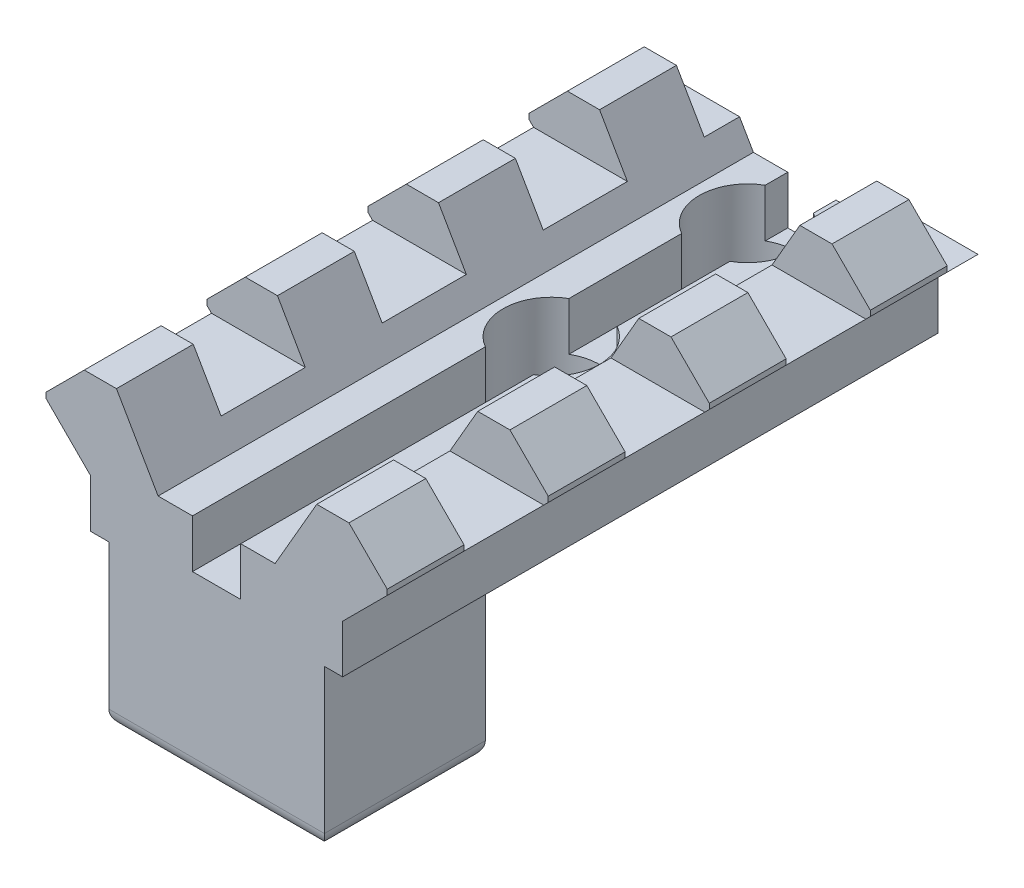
ISO-10303-21;
HEADER;
FILE_DESCRIPTION(('STEP AP214'),'2;1');
FILE_NAME('part.step','',(''),(''),'','','');
FILE_SCHEMA(('AUTOMOTIVE_DESIGN { 1 0 10303 214 1 1 1 1 }'));
ENDSEC;
DATA;
#1=APPLICATION_CONTEXT('core data for automotive mechanical design processes');
#2=APPLICATION_PROTOCOL_DEFINITION('international standard','automotive_design',2000,#1);
#3=PRODUCT_CONTEXT('',#1,'mechanical');
#4=PRODUCT('Part','Part','',(#3));
#5=PRODUCT_RELATED_PRODUCT_CATEGORY('part','',(#4));
#6=PRODUCT_DEFINITION_FORMATION('','',#4);
#7=PRODUCT_DEFINITION_CONTEXT('part definition',#1,'design');
#8=PRODUCT_DEFINITION('design','',#6,#7);
#9=PRODUCT_DEFINITION_SHAPE('','',#8);
#10=(LENGTH_UNIT() NAMED_UNIT(*) SI_UNIT(.MILLI.,.METRE.));
#11=(NAMED_UNIT(*) PLANE_ANGLE_UNIT() SI_UNIT($,.RADIAN.));
#12=(NAMED_UNIT(*) SI_UNIT($,.STERADIAN.) SOLID_ANGLE_UNIT());
#13=UNCERTAINTY_MEASURE_WITH_UNIT(LENGTH_MEASURE(1.E-05),#10,'distance_accuracy_value','');
#14=(GEOMETRIC_REPRESENTATION_CONTEXT(3) GLOBAL_UNCERTAINTY_ASSIGNED_CONTEXT((#13)) GLOBAL_UNIT_ASSIGNED_CONTEXT((#10,
#11,#12)) REPRESENTATION_CONTEXT('',''));
#15=CARTESIAN_POINT('',(0.,0.,0.));
#16=DIRECTION('',(0.,0.,1.));
#17=DIRECTION('',(1.,0.,0.));
#18=AXIS2_PLACEMENT_3D('',#15,#16,#17);
#19=CARTESIAN_POINT('',(0.,13.4864,-49.9365943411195));
#20=DIRECTION('',(0.,1.,0.));
#21=DIRECTION('',(0.,0.,1.));
#22=AXIS2_PLACEMENT_3D('',#19,#20,#21);
#23=PLANE('',#22);
#24=DIRECTION('',(0.,0.,1.));
#25=VECTOR('',#24,1.);
#26=CARTESIAN_POINT('',(-6.22536666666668,13.4864,-27.0927622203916));
#27=LINE('',#26,#25);
#28=CARTESIAN_POINT('',(-6.22536666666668,13.4864,5.13203777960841));
#29=VERTEX_POINT('',#28);
#30=CARTESIAN_POINT('',(-6.22536666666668,13.4864,9.90723777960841));
#31=VERTEX_POINT('',#30);
#32=EDGE_CURVE('E683',#29,#31,#27,.T.);
#33=ORIENTED_EDGE('',*,*,#32,.F.);
#34=DIRECTION('',(1.,0.,0.));
#35=VECTOR('',#34,1.);
#36=CARTESIAN_POINT('',(-10.6045,13.4864,5.13203777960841));
#37=LINE('',#36,#35);
#38=CARTESIAN_POINT('',(-8.22536666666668,13.4864,5.13203777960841));
#39=VERTEX_POINT('',#38);
#40=EDGE_CURVE('E798',#39,#29,#37,.T.);
#41=ORIENTED_EDGE('',*,*,#40,.F.);
#42=DIRECTION('',(0.,0.,1.));
#43=VECTOR('',#42,1.);
#44=CARTESIAN_POINT('',(-8.22536666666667,13.4864,-49.9365943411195));
#45=LINE('',#44,#43);
#46=CARTESIAN_POINT('',(-8.22536666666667,13.4864,9.90723777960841));
#47=VERTEX_POINT('',#46);
#48=EDGE_CURVE('E1008',#39,#47,#45,.T.);
#49=ORIENTED_EDGE('',*,*,#48,.T.);
#50=DIRECTION('',(-1.,0.,0.));
#51=VECTOR('',#50,1.);
#52=CARTESIAN_POINT('',(0.,13.4864,9.90723777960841));
#53=LINE('',#52,#51);
#54=EDGE_CURVE('E960',#31,#47,#53,.T.);
#55=ORIENTED_EDGE('',*,*,#54,.F.);
#56=EDGE_LOOP('',(#33,#41,#49,#55));
#57=FACE_BOUND('',#56,.T.);
#58=ADVANCED_FACE('F37',(#57),#23,.T.);
#59=CARTESIAN_POINT('',(-6.22536666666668,13.4864,-14.8879622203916));
#60=VERTEX_POINT('',#59);
#61=CARTESIAN_POINT('',(-6.22536666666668,13.4864,-10.1103622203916));
#62=VERTEX_POINT('',#61);
#63=EDGE_CURVE('E1864',#60,#62,#27,.T.);
#64=ORIENTED_EDGE('',*,*,#63,.F.);
#65=DIRECTION('',(1.,0.,0.));
#66=VECTOR('',#65,1.);
#67=CARTESIAN_POINT('',(-10.6045,13.4864,-14.8879622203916));
#68=LINE('',#67,#66);
#69=CARTESIAN_POINT('',(-8.22536666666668,13.4864,-14.8879622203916));
#70=VERTEX_POINT('',#69);
#71=EDGE_CURVE('E855',#70,#60,#68,.T.);
#72=ORIENTED_EDGE('',*,*,#71,.F.);
#73=CARTESIAN_POINT('',(-8.22536666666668,13.4864,-10.1103622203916));
#74=VERTEX_POINT('',#73);
#75=EDGE_CURVE('E1836',#70,#74,#45,.T.);
#76=ORIENTED_EDGE('',*,*,#75,.T.);
#77=DIRECTION('',(1.,0.,0.));
#78=VECTOR('',#77,1.);
#79=CARTESIAN_POINT('',(-10.6045,13.4864,-10.1103622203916));
#80=LINE('',#79,#78);
#81=EDGE_CURVE('E794',#74,#62,#80,.T.);
#82=ORIENTED_EDGE('',*,*,#81,.T.);
#83=EDGE_LOOP('',(#64,#72,#76,#82));
#84=FACE_BOUND('',#83,.T.);
#85=ADVANCED_FACE('F1220',(#84),#23,.T.);
#86=CARTESIAN_POINT('',(-6.22536666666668,13.4864,-4.87796222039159));
#87=VERTEX_POINT('',#86);
#88=CARTESIAN_POINT('',(-6.22536666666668,13.4864,-0.10036222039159));
#89=VERTEX_POINT('',#88);
#90=EDGE_CURVE('E685',#87,#89,#27,.T.);
#91=ORIENTED_EDGE('',*,*,#90,.F.);
#92=DIRECTION('',(1.,0.,0.));
#93=VECTOR('',#92,1.);
#94=CARTESIAN_POINT('',(-10.6045,13.4864,-4.87796222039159));
#95=LINE('',#94,#93);
#96=CARTESIAN_POINT('',(-8.22536666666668,13.4864,-4.87796222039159));
#97=VERTEX_POINT('',#96);
#98=EDGE_CURVE('E833',#97,#87,#95,.T.);
#99=ORIENTED_EDGE('',*,*,#98,.F.);
#100=CARTESIAN_POINT('',(-8.22536666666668,13.4864,-0.100362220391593));
#101=VERTEX_POINT('',#100);
#102=EDGE_CURVE('E1011',#97,#101,#45,.T.);
#103=ORIENTED_EDGE('',*,*,#102,.T.);
#104=DIRECTION('',(1.,0.,0.));
#105=VECTOR('',#104,1.);
#106=CARTESIAN_POINT('',(-10.6045,13.4864,-0.100362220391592));
#107=LINE('',#106,#105);
#108=EDGE_CURVE('E803',#101,#89,#107,.T.);
#109=ORIENTED_EDGE('',*,*,#108,.T.);
#110=EDGE_LOOP('',(#91,#99,#103,#109));
#111=FACE_BOUND('',#110,.T.);
#112=ADVANCED_FACE('F1225',(#111),#23,.T.);
#113=CARTESIAN_POINT('',(-10.6045,10.4892,-24.8979622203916));
#114=DIRECTION('',(0.,-1.,0.));
#115=DIRECTION('',(0.,0.,-1.));
#116=AXIS2_PLACEMENT_3D('',#113,#114,#115);
#117=PLANE('',#116);
#118=DIRECTION('',(1.,0.,0.));
#119=VECTOR('',#118,1.);
#120=CARTESIAN_POINT('',(-10.6045,10.4892,-24.8979622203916));
#121=LINE('',#120,#119);
#122=CARTESIAN_POINT('',(-10.3251,10.4892,-24.8979622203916));
#123=VERTEX_POINT('',#122);
#124=CARTESIAN_POINT('',(-4.49493243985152,10.4892,-24.8979622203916));
#125=VERTEX_POINT('',#124);
#126=EDGE_CURVE('E840',#123,#125,#121,.T.);
#127=ORIENTED_EDGE('',*,*,#126,.T.);
#128=DIRECTION('',(0.,0.,-1.));
#129=VECTOR('',#128,1.);
#130=CARTESIAN_POINT('',(-4.49493243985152,10.4892,-24.8979622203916));
#131=LINE('',#130,#129);
#132=CARTESIAN_POINT('',(-4.49493243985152,10.4892,-27.0927622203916));
#133=VERTEX_POINT('',#132);
#134=EDGE_CURVE('E764',#125,#133,#131,.T.);
#135=ORIENTED_EDGE('',*,*,#134,.T.);
#136=DIRECTION('',(1.,0.,0.));
#137=VECTOR('',#136,1.);
#138=CARTESIAN_POINT('',(-3.5,10.4892,-27.0927622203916));
#139=LINE('',#138,#137);
#140=CARTESIAN_POINT('',(-10.3251,10.4892,-27.0927622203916));
#141=VERTEX_POINT('',#140);
#142=EDGE_CURVE('E930',#141,#133,#139,.T.);
#143=ORIENTED_EDGE('',*,*,#142,.F.);
#144=DIRECTION('',(0.,0.,1.));
#145=VECTOR('',#144,1.);
#146=CARTESIAN_POINT('',(-10.3251,10.4892,-49.9365943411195));
#147=LINE('',#146,#145);
#148=EDGE_CURVE('E933',#141,#123,#147,.T.);
#149=ORIENTED_EDGE('',*,*,#148,.T.);
#150=EDGE_LOOP('',(#127,#135,#143,#149));
#151=FACE_BOUND('',#150,.T.);
#152=ADVANCED_FACE('F1343',(#151),#117,.F.);
#153=CARTESIAN_POINT('',(-10.6045,10.4892,-14.8879622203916));
#154=DIRECTION('',(0.,-1.,0.));
#155=DIRECTION('',(0.,0.,-1.));
#156=AXIS2_PLACEMENT_3D('',#153,#154,#155);
#157=PLANE('',#156);
#158=DIRECTION('',(1.,0.,0.));
#159=VECTOR('',#158,1.);
#160=CARTESIAN_POINT('',(-10.6045,10.4892,-14.8879622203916));
#161=LINE('',#160,#159);
#162=CARTESIAN_POINT('',(-10.3251,10.4892,-14.8879622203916));
#163=VERTEX_POINT('',#162);
#164=CARTESIAN_POINT('',(-4.49493243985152,10.4892,-14.8879622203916));
#165=VERTEX_POINT('',#164);
#166=EDGE_CURVE('E851',#163,#165,#161,.T.);
#167=ORIENTED_EDGE('',*,*,#166,.T.);
#168=DIRECTION('',(0.,0.,-1.));
#169=VECTOR('',#168,1.);
#170=CARTESIAN_POINT('',(-4.49493243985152,10.4892,-14.8879622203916));
#171=LINE('',#170,#169);
#172=CARTESIAN_POINT('',(-4.49493243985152,10.4892,-20.1203622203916));
#173=VERTEX_POINT('',#172);
#174=EDGE_CURVE('E755',#165,#173,#171,.T.);
#175=ORIENTED_EDGE('',*,*,#174,.T.);
#176=DIRECTION('',(1.,0.,0.));
#177=VECTOR('',#176,1.);
#178=CARTESIAN_POINT('',(-10.6045,10.4892,-20.1203622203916));
#179=LINE('',#178,#177);
#180=CARTESIAN_POINT('',(-10.3251,10.4892,-20.1203622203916));
#181=VERTEX_POINT('',#180);
#182=EDGE_CURVE('E847',#181,#173,#179,.T.);
#183=ORIENTED_EDGE('',*,*,#182,.F.);
#184=DIRECTION('',(0.,0.,1.));
#185=VECTOR('',#184,1.);
#186=CARTESIAN_POINT('',(-10.3251,10.4892,-49.9365943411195));
#187=LINE('',#186,#185);
#188=EDGE_CURVE('E935',#181,#163,#187,.T.);
#189=ORIENTED_EDGE('',*,*,#188,.T.);
#190=EDGE_LOOP('',(#167,#175,#183,#189));
#191=FACE_BOUND('',#190,.T.);
#192=ADVANCED_FACE('F1335',(#191),#157,.F.);
#193=CARTESIAN_POINT('',(-10.6045,13.4864,-14.8879622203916));
#194=DIRECTION('',(0.,0.,1.));
#195=DIRECTION('',(1.,0.,0.));
#196=AXIS2_PLACEMENT_3D('',#193,#194,#195);
#197=PLANE('',#196);
#198=ORIENTED_EDGE('',*,*,#71,.T.);
#199=DIRECTION('',(0.500000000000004,-0.866025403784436,0.));
#200=VECTOR('',#199,1.);
#201=CARTESIAN_POINT('',(-7.32015000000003,15.382620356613,-14.8879622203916));
#202=LINE('',#201,#200);
#203=EDGE_CURVE('E752',#60,#165,#202,.T.);
#204=ORIENTED_EDGE('',*,*,#203,.T.);
#205=ORIENTED_EDGE('',*,*,#166,.F.);
#206=DIRECTION('',(-0.707106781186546,0.707106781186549,0.));
#207=VECTOR('',#206,1.);
#208=CARTESIAN_POINT('',(0.0820499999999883,0.082049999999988,-14.8879622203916));
#209=LINE('',#208,#207);
#210=CARTESIAN_POINT('',(-10.6045,10.7686,-14.8879622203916));
#211=VERTEX_POINT('',#210);
#212=EDGE_CURVE('E878',#163,#211,#209,.T.);
#213=ORIENTED_EDGE('',*,*,#212,.T.);
#214=DIRECTION('',(0.,-1.,0.));
#215=VECTOR('',#214,1.);
#216=CARTESIAN_POINT('',(-10.6045,13.4864,-14.8879622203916));
#217=LINE('',#216,#215);
#218=CARTESIAN_POINT('',(-10.6045,11.1072666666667,-14.8879622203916));
#219=VERTEX_POINT('',#218);
#220=EDGE_CURVE('E836',#219,#211,#217,.T.);
#221=ORIENTED_EDGE('',*,*,#220,.F.);
#222=DIRECTION('',(0.707106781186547,0.707106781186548,0.));
#223=VECTOR('',#222,1.);
#224=CARTESIAN_POINT('',(-10.8558833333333,10.8558833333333,-14.8879622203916));
#225=LINE('',#224,#223);
#226=EDGE_CURVE('E880',#219,#70,#225,.T.);
#227=ORIENTED_EDGE('',*,*,#226,.T.);
#228=EDGE_LOOP('',(#198,#204,#205,#213,#221,#227));
#229=FACE_BOUND('',#228,.T.);
#230=ADVANCED_FACE('F1327',(#229),#197,.F.);
#231=CARTESIAN_POINT('',(-10.6045,10.4892,-4.87796222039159));
#232=DIRECTION('',(0.,-1.,0.));
#233=DIRECTION('',(0.,0.,-1.));
#234=AXIS2_PLACEMENT_3D('',#231,#232,#233);
#235=PLANE('',#234);
#236=DIRECTION('',(1.,0.,0.));
#237=VECTOR('',#236,1.);
#238=CARTESIAN_POINT('',(-10.6045,10.4892,-4.87796222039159));
#239=LINE('',#238,#237);
#240=CARTESIAN_POINT('',(-10.3251,10.4892,-4.87796222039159));
#241=VERTEX_POINT('',#240);
#242=CARTESIAN_POINT('',(-4.49493243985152,10.4892,-4.87796222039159));
#243=VERTEX_POINT('',#242);
#244=EDGE_CURVE('E829',#241,#243,#239,.T.);
#245=ORIENTED_EDGE('',*,*,#244,.T.);
#246=DIRECTION('',(0.,0.,-1.));
#247=VECTOR('',#246,1.);
#248=CARTESIAN_POINT('',(-4.49493243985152,10.4892,-4.87796222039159));
#249=LINE('',#248,#247);
#250=CARTESIAN_POINT('',(-4.49493243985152,10.4892,-10.1103622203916));
#251=VERTEX_POINT('',#250);
#252=EDGE_CURVE('E746',#243,#251,#249,.T.);
#253=ORIENTED_EDGE('',*,*,#252,.T.);
#254=DIRECTION('',(1.,0.,0.));
#255=VECTOR('',#254,1.);
#256=CARTESIAN_POINT('',(-10.6045,10.4892,-10.1103622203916));
#257=LINE('',#256,#255);
#258=CARTESIAN_POINT('',(-10.3251,10.4892,-10.1103622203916));
#259=VERTEX_POINT('',#258);
#260=EDGE_CURVE('E825',#259,#251,#257,.T.);
#261=ORIENTED_EDGE('',*,*,#260,.F.);
#262=DIRECTION('',(0.,0.,1.));
#263=VECTOR('',#262,1.);
#264=CARTESIAN_POINT('',(-10.3251,10.4892,-49.9365943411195));
#265=LINE('',#264,#263);
#266=EDGE_CURVE('E937',#259,#241,#265,.T.);
#267=ORIENTED_EDGE('',*,*,#266,.T.);
#268=EDGE_LOOP('',(#245,#253,#261,#267));
#269=FACE_BOUND('',#268,.T.);
#270=ADVANCED_FACE('F1319',(#269),#235,.F.);
#271=CARTESIAN_POINT('',(-10.6045,13.4864,-4.87796222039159));
#272=DIRECTION('',(0.,0.,1.));
#273=DIRECTION('',(1.,0.,0.));
#274=AXIS2_PLACEMENT_3D('',#271,#272,#273);
#275=PLANE('',#274);
#276=ORIENTED_EDGE('',*,*,#98,.T.);
#277=DIRECTION('',(0.500000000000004,-0.866025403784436,0.));
#278=VECTOR('',#277,1.);
#279=CARTESIAN_POINT('',(-7.32015000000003,15.382620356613,-4.87796222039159));
#280=LINE('',#279,#278);
#281=EDGE_CURVE('E743',#87,#243,#280,.T.);
#282=ORIENTED_EDGE('',*,*,#281,.T.);
#283=ORIENTED_EDGE('',*,*,#244,.F.);
#284=DIRECTION('',(-0.707106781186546,0.707106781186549,0.));
#285=VECTOR('',#284,1.);
#286=CARTESIAN_POINT('',(0.0820499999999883,0.082049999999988,-4.87796222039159));
#287=LINE('',#286,#285);
#288=CARTESIAN_POINT('',(-10.6045,10.7686,-4.87796222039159));
#289=VERTEX_POINT('',#288);
#290=EDGE_CURVE('E896',#241,#289,#287,.T.);
#291=ORIENTED_EDGE('',*,*,#290,.T.);
#292=DIRECTION('',(0.,-1.,0.));
#293=VECTOR('',#292,1.);
#294=CARTESIAN_POINT('',(-10.6045,13.4864,-4.87796222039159));
#295=LINE('',#294,#293);
#296=CARTESIAN_POINT('',(-10.6045,11.1072666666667,-4.87796222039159));
#297=VERTEX_POINT('',#296);
#298=EDGE_CURVE('E814',#297,#289,#295,.T.);
#299=ORIENTED_EDGE('',*,*,#298,.F.);
#300=DIRECTION('',(0.707106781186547,0.707106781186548,0.));
#301=VECTOR('',#300,1.);
#302=CARTESIAN_POINT('',(-10.8558833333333,10.8558833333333,-4.87796222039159));
#303=LINE('',#302,#301);
#304=EDGE_CURVE('E898',#297,#97,#303,.T.);
#305=ORIENTED_EDGE('',*,*,#304,.T.);
#306=EDGE_LOOP('',(#276,#282,#283,#291,#299,#305));
#307=FACE_BOUND('',#306,.T.);
#308=ADVANCED_FACE('F1311',(#307),#275,.F.);
#309=CARTESIAN_POINT('',(-10.6045,13.4864,5.13203777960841));
#310=DIRECTION('',(0.,0.,1.));
#311=DIRECTION('',(1.,0.,0.));
#312=AXIS2_PLACEMENT_3D('',#309,#310,#311);
#313=PLANE('',#312);
#314=ORIENTED_EDGE('',*,*,#40,.T.);
#315=DIRECTION('',(0.500000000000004,-0.866025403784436,0.));
#316=VECTOR('',#315,1.);
#317=CARTESIAN_POINT('',(-7.32015000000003,15.382620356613,5.13203777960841));
#318=LINE('',#317,#316);
#319=CARTESIAN_POINT('',(-4.49493243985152,10.4892,5.13203777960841));
#320=VERTEX_POINT('',#319);
#321=EDGE_CURVE('E740',#29,#320,#318,.T.);
#322=ORIENTED_EDGE('',*,*,#321,.T.);
#323=DIRECTION('',(1.,0.,0.));
#324=VECTOR('',#323,1.);
#325=CARTESIAN_POINT('',(-10.6045,10.4892,5.13203777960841));
#326=LINE('',#325,#324);
#327=CARTESIAN_POINT('',(-10.3251,10.4892,5.13203777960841));
#328=VERTEX_POINT('',#327);
#329=EDGE_CURVE('E811',#328,#320,#326,.T.);
#330=ORIENTED_EDGE('',*,*,#329,.F.);
#331=DIRECTION('',(-0.707106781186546,0.707106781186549,0.));
#332=VECTOR('',#331,1.);
#333=CARTESIAN_POINT('',(0.0820499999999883,0.082049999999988,5.13203777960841));
#334=LINE('',#333,#332);
#335=CARTESIAN_POINT('',(-10.6045,10.7686,5.13203777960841));
#336=VERTEX_POINT('',#335);
#337=EDGE_CURVE('E923',#328,#336,#334,.T.);
#338=ORIENTED_EDGE('',*,*,#337,.T.);
#339=DIRECTION('',(0.,-1.,0.));
#340=VECTOR('',#339,1.);
#341=CARTESIAN_POINT('',(-10.6045,13.4864,5.13203777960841));
#342=LINE('',#341,#340);
#343=CARTESIAN_POINT('',(-10.6045,11.1072666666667,5.13203777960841));
#344=VERTEX_POINT('',#343);
#345=EDGE_CURVE('E790',#344,#336,#342,.T.);
#346=ORIENTED_EDGE('',*,*,#345,.F.);
#347=DIRECTION('',(0.707106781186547,0.707106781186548,0.));
#348=VECTOR('',#347,1.);
#349=CARTESIAN_POINT('',(-10.8558833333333,10.8558833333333,5.13203777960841));
#350=LINE('',#349,#348);
#351=EDGE_CURVE('E925',#344,#39,#350,.T.);
#352=ORIENTED_EDGE('',*,*,#351,.T.);
#353=EDGE_LOOP('',(#314,#322,#330,#338,#346,#352));
#354=FACE_BOUND('',#353,.T.);
#355=ADVANCED_FACE('F1303',(#354),#313,.F.);
#356=CARTESIAN_POINT('',(-10.6045,13.4864,-0.100362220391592));
#357=DIRECTION('',(0.,0.,-1.));
#358=DIRECTION('',(0.,1.,0.));
#359=AXIS2_PLACEMENT_3D('',#356,#357,#358);
#360=PLANE('',#359);
#361=DIRECTION('',(1.,0.,0.));
#362=VECTOR('',#361,1.);
#363=CARTESIAN_POINT('',(-10.6045,10.4892,-0.100362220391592));
#364=LINE('',#363,#362);
#365=CARTESIAN_POINT('',(-10.3251,10.4892,-0.100362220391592));
#366=VERTEX_POINT('',#365);
#367=CARTESIAN_POINT('',(-4.49493243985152,10.4892,-0.100362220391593));
#368=VERTEX_POINT('',#367);
#369=EDGE_CURVE('E807',#366,#368,#364,.T.);
#370=ORIENTED_EDGE('',*,*,#369,.T.);
#371=DIRECTION('',(-0.500000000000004,0.866025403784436,0.));
#372=VECTOR('',#371,1.);
#373=CARTESIAN_POINT('',(-7.32015000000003,15.382620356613,-0.100362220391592));
#374=LINE('',#373,#372);
#375=EDGE_CURVE('E737',#368,#89,#374,.T.);
#376=ORIENTED_EDGE('',*,*,#375,.T.);
#377=ORIENTED_EDGE('',*,*,#108,.F.);
#378=DIRECTION('',(-0.707106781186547,-0.707106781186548,0.));
#379=VECTOR('',#378,1.);
#380=CARTESIAN_POINT('',(-10.8558833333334,10.8558833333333,-0.100362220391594));
#381=LINE('',#380,#379);
#382=CARTESIAN_POINT('',(-10.6045,11.1072666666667,-0.100362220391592));
#383=VERTEX_POINT('',#382);
#384=EDGE_CURVE('E915',#101,#383,#381,.T.);
#385=ORIENTED_EDGE('',*,*,#384,.T.);
#386=DIRECTION('',(0.,1.,0.));
#387=VECTOR('',#386,1.);
#388=CARTESIAN_POINT('',(-10.6045,13.4864,-0.100362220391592));
#389=LINE('',#388,#387);
#390=CARTESIAN_POINT('',(-10.6045,10.7686,-0.100362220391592));
#391=VERTEX_POINT('',#390);
#392=EDGE_CURVE('E793',#391,#383,#389,.T.);
#393=ORIENTED_EDGE('',*,*,#392,.F.);
#394=DIRECTION('',(0.707106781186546,-0.707106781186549,0.));
#395=VECTOR('',#394,1.);
#396=CARTESIAN_POINT('',(0.0820499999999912,0.0820499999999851,-0.100362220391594));
#397=LINE('',#396,#395);
#398=EDGE_CURVE('E913',#391,#366,#397,.T.);
#399=ORIENTED_EDGE('',*,*,#398,.T.);
#400=EDGE_LOOP('',(#370,#376,#377,#385,#393,#399));
#401=FACE_BOUND('',#400,.T.);
#402=ADVANCED_FACE('F1295',(#401),#360,.F.);
#403=CARTESIAN_POINT('',(-10.6045,10.4892,5.13203777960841));
#404=DIRECTION('',(0.,-1.,0.));
#405=DIRECTION('',(0.,0.,-1.));
#406=AXIS2_PLACEMENT_3D('',#403,#404,#405);
#407=PLANE('',#406);
#408=ORIENTED_EDGE('',*,*,#329,.T.);
#409=DIRECTION('',(0.,0.,-1.));
#410=VECTOR('',#409,1.);
#411=CARTESIAN_POINT('',(-4.49493243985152,10.4892,5.13203777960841));
#412=LINE('',#411,#410);
#413=EDGE_CURVE('E590',#320,#368,#412,.T.);
#414=ORIENTED_EDGE('',*,*,#413,.T.);
#415=ORIENTED_EDGE('',*,*,#369,.F.);
#416=DIRECTION('',(0.,0.,1.));
#417=VECTOR('',#416,1.);
#418=CARTESIAN_POINT('',(-10.3251,10.4892,-49.9365943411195));
#419=LINE('',#418,#417);
#420=EDGE_CURVE('E939',#366,#328,#419,.T.);
#421=ORIENTED_EDGE('',*,*,#420,.T.);
#422=EDGE_LOOP('',(#408,#414,#415,#421));
#423=FACE_BOUND('',#422,.T.);
#424=ADVANCED_FACE('F1289',(#423),#407,.F.);
#425=DIRECTION('',(0.,0.,1.));
#426=VECTOR('',#425,1.);
#427=CARTESIAN_POINT('',(6.22536666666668,13.4864,-27.0927622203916));
#428=LINE('',#427,#426);
#429=CARTESIAN_POINT('',(6.22536666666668,13.4864,-24.8979622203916));
#430=VERTEX_POINT('',#429);
#431=CARTESIAN_POINT('',(6.22536666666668,13.4864,-20.1203622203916));
#432=VERTEX_POINT('',#431);
#433=EDGE_CURVE('E686',#430,#432,#428,.T.);
#434=ORIENTED_EDGE('',*,*,#433,.T.);
#435=DIRECTION('',(1.,0.,0.));
#436=VECTOR('',#435,1.);
#437=CARTESIAN_POINT('',(-10.6045,13.4864,-20.1203622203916));
#438=LINE('',#437,#436);
#439=CARTESIAN_POINT('',(8.22536666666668,13.4864,-20.1203622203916));
#440=VERTEX_POINT('',#439);
#441=EDGE_CURVE('E846',#432,#440,#438,.T.);
#442=ORIENTED_EDGE('',*,*,#441,.T.);
#443=DIRECTION('',(0.,0.,1.));
#444=VECTOR('',#443,1.);
#445=CARTESIAN_POINT('',(8.22536666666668,13.4864,-49.9365943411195));
#446=LINE('',#445,#444);
#447=CARTESIAN_POINT('',(8.22536666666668,13.4864,-24.8979622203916));
#448=VERTEX_POINT('',#447);
#449=EDGE_CURVE('E1012',#448,#440,#446,.T.);
#450=ORIENTED_EDGE('',*,*,#449,.F.);
#451=DIRECTION('',(1.,0.,0.));
#452=VECTOR('',#451,1.);
#453=CARTESIAN_POINT('',(-10.6045,13.4864,-24.8979622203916));
#454=LINE('',#453,#452);
#455=EDGE_CURVE('E860',#430,#448,#454,.T.);
#456=ORIENTED_EDGE('',*,*,#455,.F.);
#457=EDGE_LOOP('',(#434,#442,#450,#456));
#458=FACE_BOUND('',#457,.T.);
#459=ADVANCED_FACE('F1148',(#458),#23,.T.);
#460=CARTESIAN_POINT('',(-10.6045,13.4864,-24.8979622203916));
#461=DIRECTION('',(0.,0.,1.));
#462=DIRECTION('',(1.,0.,0.));
#463=AXIS2_PLACEMENT_3D('',#460,#461,#462);
#464=PLANE('',#463);
#465=CARTESIAN_POINT('',(4.49493243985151,10.4892,-24.8979622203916));
#466=VERTEX_POINT('',#465);
#467=CARTESIAN_POINT('',(10.3251,10.4892,-24.8979622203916));
#468=VERTEX_POINT('',#467);
#469=EDGE_CURVE('E863',#466,#468,#121,.T.);
#470=ORIENTED_EDGE('',*,*,#469,.F.);
#471=DIRECTION('',(0.500000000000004,0.866025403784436,0.));
#472=VECTOR('',#471,1.);
#473=CARTESIAN_POINT('',(2.01789999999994,6.19885396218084,-24.8979622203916));
#474=LINE('',#473,#472);
#475=EDGE_CURVE('E734',#466,#430,#474,.T.);
#476=ORIENTED_EDGE('',*,*,#475,.T.);
#477=ORIENTED_EDGE('',*,*,#455,.T.);
#478=DIRECTION('',(0.707106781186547,-0.707106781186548,0.));
#479=VECTOR('',#478,1.);
#480=CARTESIAN_POINT('',(10.8558833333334,10.8558833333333,-24.8979622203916));
#481=LINE('',#480,#479);
#482=CARTESIAN_POINT('',(10.6045,11.1072666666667,-24.8979622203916));
#483=VERTEX_POINT('',#482);
#484=EDGE_CURVE('E873',#448,#483,#481,.T.);
#485=ORIENTED_EDGE('',*,*,#484,.T.);
#486=DIRECTION('',(0.,1.,0.));
#487=VECTOR('',#486,1.);
#488=CARTESIAN_POINT('',(10.6045,0.,-24.8979622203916));
#489=LINE('',#488,#487);
#490=CARTESIAN_POINT('',(10.6045,10.7686,-24.8979622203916));
#491=VERTEX_POINT('',#490);
#492=EDGE_CURVE('E546',#491,#483,#489,.T.);
#493=ORIENTED_EDGE('',*,*,#492,.F.);
#494=DIRECTION('',(-0.707106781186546,-0.707106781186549,0.));
#495=VECTOR('',#494,1.);
#496=CARTESIAN_POINT('',(-0.0820499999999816,0.0820499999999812,-24.8979622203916));
#497=LINE('',#496,#495);
#498=EDGE_CURVE('E801',#491,#468,#497,.T.);
#499=ORIENTED_EDGE('',*,*,#498,.T.);
#500=EDGE_LOOP('',(#470,#476,#477,#485,#493,#499));
#501=FACE_BOUND('',#500,.T.);
#502=ADVANCED_FACE('F1273',(#501),#464,.F.);
#503=CARTESIAN_POINT('',(-10.6045,13.4864,-20.1203622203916));
#504=DIRECTION('',(0.,0.,-1.));
#505=DIRECTION('',(0.,1.,0.));
#506=AXIS2_PLACEMENT_3D('',#503,#504,#505);
#507=PLANE('',#506);
#508=ORIENTED_EDGE('',*,*,#182,.T.);
#509=DIRECTION('',(-0.500000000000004,0.866025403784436,0.));
#510=VECTOR('',#509,1.);
#511=CARTESIAN_POINT('',(-7.32015000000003,15.382620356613,-20.1203622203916));
#512=LINE('',#511,#510);
#513=CARTESIAN_POINT('',(-6.22536666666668,13.4864,-20.1203622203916));
#514=VERTEX_POINT('',#513);
#515=EDGE_CURVE('E758',#173,#514,#512,.T.);
#516=ORIENTED_EDGE('',*,*,#515,.T.);
#517=CARTESIAN_POINT('',(-8.22536666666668,13.4864,-20.1203622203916));
#518=VERTEX_POINT('',#517);
#519=EDGE_CURVE('E818',#518,#514,#438,.T.);
#520=ORIENTED_EDGE('',*,*,#519,.F.);
#521=DIRECTION('',(-0.707106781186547,-0.707106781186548,0.));
#522=VECTOR('',#521,1.);
#523=CARTESIAN_POINT('',(-10.8558833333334,10.8558833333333,-20.1203622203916));
#524=LINE('',#523,#522);
#525=CARTESIAN_POINT('',(-10.6045,11.1072666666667,-20.1203622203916));
#526=VERTEX_POINT('',#525);
#527=EDGE_CURVE('E888',#518,#526,#524,.T.);
#528=ORIENTED_EDGE('',*,*,#527,.T.);
#529=DIRECTION('',(0.,1.,0.));
#530=VECTOR('',#529,1.);
#531=CARTESIAN_POINT('',(-10.6045,13.4864,-20.1203622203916));
#532=LINE('',#531,#530);
#533=CARTESIAN_POINT('',(-10.6045,10.7686,-20.1203622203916));
#534=VERTEX_POINT('',#533);
#535=EDGE_CURVE('E839',#534,#526,#532,.T.);
#536=ORIENTED_EDGE('',*,*,#535,.F.);
#537=DIRECTION('',(0.707106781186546,-0.707106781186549,0.));
#538=VECTOR('',#537,1.);
#539=CARTESIAN_POINT('',(0.0820500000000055,0.0820499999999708,-20.1203622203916));
#540=LINE('',#539,#538);
#541=EDGE_CURVE('E886',#534,#181,#540,.T.);
#542=ORIENTED_EDGE('',*,*,#541,.T.);
#543=EDGE_LOOP('',(#508,#516,#520,#528,#536,#542));
#544=FACE_BOUND('',#543,.T.);
#545=ADVANCED_FACE('F1264',(#544),#507,.F.);
#546=CARTESIAN_POINT('',(-10.6045,13.4864,-10.1103622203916));
#547=DIRECTION('',(0.,0.,-1.));
#548=DIRECTION('',(-1.,0.,0.));
#549=AXIS2_PLACEMENT_3D('',#546,#547,#548);
#550=PLANE('',#549);
#551=ORIENTED_EDGE('',*,*,#260,.T.);
#552=DIRECTION('',(-0.500000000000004,0.866025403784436,0.));
#553=VECTOR('',#552,1.);
#554=CARTESIAN_POINT('',(-7.32015000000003,15.382620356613,-10.1103622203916));
#555=LINE('',#554,#553);
#556=EDGE_CURVE('E749',#251,#62,#555,.T.);
#557=ORIENTED_EDGE('',*,*,#556,.T.);
#558=ORIENTED_EDGE('',*,*,#81,.F.);
#559=DIRECTION('',(-0.707106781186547,-0.707106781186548,0.));
#560=VECTOR('',#559,1.);
#561=CARTESIAN_POINT('',(-10.8558833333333,10.8558833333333,-10.1103622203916));
#562=LINE('',#561,#560);
#563=CARTESIAN_POINT('',(-10.6045,11.1072666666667,-10.1103622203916));
#564=VERTEX_POINT('',#563);
#565=EDGE_CURVE('E906',#74,#564,#562,.T.);
#566=ORIENTED_EDGE('',*,*,#565,.T.);
#567=DIRECTION('',(0.,1.,0.));
#568=VECTOR('',#567,1.);
#569=CARTESIAN_POINT('',(-10.6045,13.4864,-10.1103622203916));
#570=LINE('',#569,#568);
#571=CARTESIAN_POINT('',(-10.6045,10.7686,-10.1103622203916));
#572=VERTEX_POINT('',#571);
#573=EDGE_CURVE('E817',#572,#564,#570,.T.);
#574=ORIENTED_EDGE('',*,*,#573,.F.);
#575=DIRECTION('',(0.707106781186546,-0.707106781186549,0.));
#576=VECTOR('',#575,1.);
#577=CARTESIAN_POINT('',(0.0820499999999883,0.082049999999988,-10.1103622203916));
#578=LINE('',#577,#576);
#579=EDGE_CURVE('E904',#572,#259,#578,.T.);
#580=ORIENTED_EDGE('',*,*,#579,.T.);
#581=EDGE_LOOP('',(#551,#557,#558,#566,#574,#580));
#582=FACE_BOUND('',#581,.T.);
#583=ADVANCED_FACE('F1246',(#582),#550,.F.);
#584=CARTESIAN_POINT('',(10.8558833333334,10.8558833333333,-49.9365943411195));
#585=DIRECTION('',(0.707106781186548,0.707106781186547,0.));
#586=DIRECTION('',(-0.707106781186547,0.707106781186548,0.));
#587=AXIS2_PLACEMENT_3D('',#584,#585,#586);
#588=PLANE('',#587);
#589=DIRECTION('',(0.707106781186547,-0.707106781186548,0.));
#590=VECTOR('',#589,1.);
#591=CARTESIAN_POINT('',(10.8558833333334,10.8558833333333,5.13203777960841));
#592=LINE('',#591,#590);
#593=CARTESIAN_POINT('',(8.22536666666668,13.4864,5.13203777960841));
#594=VERTEX_POINT('',#593);
#595=CARTESIAN_POINT('',(10.6045,11.1072666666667,5.13203777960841));
#596=VERTEX_POINT('',#595);
#597=EDGE_CURVE('E927',#594,#596,#592,.T.);
#598=ORIENTED_EDGE('',*,*,#597,.F.);
#599=CARTESIAN_POINT('',(8.22536666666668,13.4864,9.90723777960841));
#600=VERTEX_POINT('',#599);
#601=EDGE_CURVE('E1013',#594,#600,#446,.T.);
#602=ORIENTED_EDGE('',*,*,#601,.T.);
#603=DIRECTION('',(-0.707106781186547,0.707106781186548,0.));
#604=VECTOR('',#603,1.);
#605=CARTESIAN_POINT('',(10.8558833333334,10.8558833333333,9.90723777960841));
#606=LINE('',#605,#604);
#607=CARTESIAN_POINT('',(10.6045,11.1072666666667,9.90723777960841));
#608=VERTEX_POINT('',#607);
#609=EDGE_CURVE('E957',#608,#600,#606,.T.);
#610=ORIENTED_EDGE('',*,*,#609,.F.);
#611=DIRECTION('',(0.,0.,1.));
#612=VECTOR('',#611,1.);
#613=CARTESIAN_POINT('',(10.6045,11.1072666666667,-49.9365943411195));
#614=LINE('',#613,#612);
#615=EDGE_CURVE('E986',#596,#608,#614,.T.);
#616=ORIENTED_EDGE('',*,*,#615,.F.);
#617=EDGE_LOOP('',(#598,#602,#610,#616));
#618=FACE_BOUND('',#617,.T.);
#619=ADVANCED_FACE('F1111',(#618),#588,.T.);
#620=DIRECTION('',(-0.707106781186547,0.707106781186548,0.));
#621=VECTOR('',#620,1.);
#622=CARTESIAN_POINT('',(10.8558833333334,10.8558833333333,-10.1103622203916));
#623=LINE('',#622,#621);
#624=CARTESIAN_POINT('',(10.6045,11.1072666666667,-10.1103622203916));
#625=VERTEX_POINT('',#624);
#626=CARTESIAN_POINT('',(8.22536666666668,13.4864,-10.1103622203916));
#627=VERTEX_POINT('',#626);
#628=EDGE_CURVE('E908',#625,#627,#623,.T.);
#629=ORIENTED_EDGE('',*,*,#628,.F.);
#630=CARTESIAN_POINT('',(10.6045,11.1072666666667,-14.8879622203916));
#631=VERTEX_POINT('',#630);
#632=EDGE_CURVE('E1192',#631,#625,#614,.T.);
#633=ORIENTED_EDGE('',*,*,#632,.F.);
#634=DIRECTION('',(0.707106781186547,-0.707106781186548,0.));
#635=VECTOR('',#634,1.);
#636=CARTESIAN_POINT('',(10.8558833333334,10.8558833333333,-14.8879622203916));
#637=LINE('',#636,#635);
#638=CARTESIAN_POINT('',(8.22536666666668,13.4864,-14.8879622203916));
#639=VERTEX_POINT('',#638);
#640=EDGE_CURVE('E882',#639,#631,#637,.T.);
#641=ORIENTED_EDGE('',*,*,#640,.F.);
#642=EDGE_CURVE('E1160',#639,#627,#446,.T.);
#643=ORIENTED_EDGE('',*,*,#642,.T.);
#644=EDGE_LOOP('',(#629,#633,#641,#643));
#645=FACE_BOUND('',#644,.T.);
#646=ADVANCED_FACE('F1197',(#645),#588,.T.);
#647=DIRECTION('',(-0.707106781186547,0.707106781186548,0.));
#648=VECTOR('',#647,1.);
#649=CARTESIAN_POINT('',(10.8558833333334,10.8558833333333,-20.1203622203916));
#650=LINE('',#649,#648);
#651=CARTESIAN_POINT('',(10.6045,11.1072666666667,-20.1203622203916));
#652=VERTEX_POINT('',#651);
#653=EDGE_CURVE('E890',#652,#440,#650,.T.);
#654=ORIENTED_EDGE('',*,*,#653,.F.);
#655=EDGE_CURVE('E1016',#483,#652,#614,.T.);
#656=ORIENTED_EDGE('',*,*,#655,.F.);
#657=ORIENTED_EDGE('',*,*,#484,.F.);
#658=ORIENTED_EDGE('',*,*,#449,.T.);
#659=EDGE_LOOP('',(#654,#656,#657,#658));
#660=FACE_BOUND('',#659,.T.);
#661=ADVANCED_FACE('F1159',(#660),#588,.T.);
#662=CARTESIAN_POINT('',(6.22536666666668,13.4864,5.13203777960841));
#663=VERTEX_POINT('',#662);
#664=CARTESIAN_POINT('',(6.22536666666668,13.4864,9.90723777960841));
#665=VERTEX_POINT('',#664);
#666=EDGE_CURVE('E687',#663,#665,#428,.T.);
#667=ORIENTED_EDGE('',*,*,#666,.T.);
#668=EDGE_CURVE('E961',#600,#665,#53,.T.);
#669=ORIENTED_EDGE('',*,*,#668,.F.);
#670=ORIENTED_EDGE('',*,*,#601,.F.);
#671=EDGE_CURVE('E802',#663,#594,#37,.T.);
#672=ORIENTED_EDGE('',*,*,#671,.F.);
#673=EDGE_LOOP('',(#667,#669,#670,#672));
#674=FACE_BOUND('',#673,.T.);
#675=ADVANCED_FACE('F1103',(#674),#23,.T.);
#676=CARTESIAN_POINT('',(6.22536666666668,13.4864,-14.8879622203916));
#677=VERTEX_POINT('',#676);
#678=CARTESIAN_POINT('',(6.22536666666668,13.4864,-10.1103622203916));
#679=VERTEX_POINT('',#678);
#680=EDGE_CURVE('E1139',#677,#679,#428,.T.);
#681=ORIENTED_EDGE('',*,*,#680,.T.);
#682=EDGE_CURVE('E824',#679,#627,#80,.T.);
#683=ORIENTED_EDGE('',*,*,#682,.T.);
#684=ORIENTED_EDGE('',*,*,#642,.F.);
#685=EDGE_CURVE('E843',#677,#639,#68,.T.);
#686=ORIENTED_EDGE('',*,*,#685,.F.);
#687=EDGE_LOOP('',(#681,#683,#684,#686));
#688=FACE_BOUND('',#687,.T.);
#689=ADVANCED_FACE('F1207',(#688),#23,.T.);
#690=CARTESIAN_POINT('',(-6.22536666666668,13.4864,-24.8979622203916));
#691=VERTEX_POINT('',#690);
#692=EDGE_CURVE('E682',#691,#514,#27,.T.);
#693=ORIENTED_EDGE('',*,*,#692,.F.);
#694=CARTESIAN_POINT('',(-8.22536666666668,13.4864,-24.8979622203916));
#695=VERTEX_POINT('',#694);
#696=EDGE_CURVE('E864',#695,#691,#454,.T.);
#697=ORIENTED_EDGE('',*,*,#696,.F.);
#698=EDGE_CURVE('E1007',#695,#518,#45,.T.);
#699=ORIENTED_EDGE('',*,*,#698,.T.);
#700=ORIENTED_EDGE('',*,*,#519,.T.);
#701=EDGE_LOOP('',(#693,#697,#699,#700));
#702=FACE_BOUND('',#701,.T.);
#703=ADVANCED_FACE('F1209',(#702),#23,.T.);
#704=CARTESIAN_POINT('',(-10.8558833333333,10.8558833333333,-49.9365943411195));
#705=DIRECTION('',(-0.707106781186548,0.707106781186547,0.));
#706=DIRECTION('',(-0.707106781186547,-0.707106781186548,0.));
#707=AXIS2_PLACEMENT_3D('',#704,#705,#706);
#708=PLANE('',#707);
#709=ORIENTED_EDGE('',*,*,#351,.F.);
#710=DIRECTION('',(0.,0.,1.));
#711=VECTOR('',#710,1.);
#712=CARTESIAN_POINT('',(-10.6045,11.1072666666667,-49.9365943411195));
#713=LINE('',#712,#711);
#714=CARTESIAN_POINT('',(-10.6045,11.1072666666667,9.90723777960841));
#715=VERTEX_POINT('',#714);
#716=EDGE_CURVE('E1004',#344,#715,#713,.T.);
#717=ORIENTED_EDGE('',*,*,#716,.T.);
#718=DIRECTION('',(-0.707106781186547,-0.707106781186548,0.));
#719=VECTOR('',#718,1.);
#720=CARTESIAN_POINT('',(-10.8558833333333,10.8558833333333,9.90723777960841));
#721=LINE('',#720,#719);
#722=EDGE_CURVE('E964',#47,#715,#721,.T.);
#723=ORIENTED_EDGE('',*,*,#722,.F.);
#724=ORIENTED_EDGE('',*,*,#48,.F.);
#725=EDGE_LOOP('',(#709,#717,#723,#724));
#726=FACE_BOUND('',#725,.T.);
#727=ADVANCED_FACE('F1215',(#726),#708,.T.);
#728=ORIENTED_EDGE('',*,*,#565,.F.);
#729=ORIENTED_EDGE('',*,*,#75,.F.);
#730=ORIENTED_EDGE('',*,*,#226,.F.);
#731=EDGE_CURVE('E1868',#219,#564,#713,.T.);
#732=ORIENTED_EDGE('',*,*,#731,.T.);
#733=EDGE_LOOP('',(#728,#729,#730,#732));
#734=FACE_BOUND('',#733,.T.);
#735=ADVANCED_FACE('F1484',(#734),#708,.T.);
#736=ORIENTED_EDGE('',*,*,#527,.F.);
#737=ORIENTED_EDGE('',*,*,#698,.F.);
#738=DIRECTION('',(0.707106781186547,0.707106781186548,0.));
#739=VECTOR('',#738,1.);
#740=CARTESIAN_POINT('',(-10.8558833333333,10.8558833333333,-24.8979622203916));
#741=LINE('',#740,#739);
#742=CARTESIAN_POINT('',(-10.6045,11.1072666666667,-24.8979622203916));
#743=VERTEX_POINT('',#742);
#744=EDGE_CURVE('E871',#743,#695,#741,.T.);
#745=ORIENTED_EDGE('',*,*,#744,.F.);
#746=EDGE_CURVE('E1003',#743,#526,#713,.T.);
#747=ORIENTED_EDGE('',*,*,#746,.T.);
#748=EDGE_LOOP('',(#736,#737,#745,#747));
#749=FACE_BOUND('',#748,.T.);
#750=ADVANCED_FACE('F1236',(#749),#708,.T.);
#751=CARTESIAN_POINT('',(-10.6045,0.,-49.9365943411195));
#752=DIRECTION('',(-1.,0.,0.));
#753=DIRECTION('',(0.,0.,1.));
#754=AXIS2_PLACEMENT_3D('',#751,#752,#753);
#755=PLANE('',#754);
#756=ORIENTED_EDGE('',*,*,#345,.T.);
#757=DIRECTION('',(0.,0.,1.));
#758=VECTOR('',#757,1.);
#759=CARTESIAN_POINT('',(-10.6045,10.7686,-49.9365943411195));
#760=LINE('',#759,#758);
#761=CARTESIAN_POINT('',(-10.6045,10.7686,9.90723777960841));
#762=VERTEX_POINT('',#761);
#763=EDGE_CURVE('E1000',#336,#762,#760,.T.);
#764=ORIENTED_EDGE('',*,*,#763,.T.);
#765=DIRECTION('',(0.,-1.,0.));
#766=VECTOR('',#765,1.);
#767=CARTESIAN_POINT('',(-10.6045,0.,9.90723777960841));
#768=LINE('',#767,#766);
#769=EDGE_CURVE('E967',#715,#762,#768,.T.);
#770=ORIENTED_EDGE('',*,*,#769,.F.);
#771=ORIENTED_EDGE('',*,*,#716,.F.);
#772=EDGE_LOOP('',(#756,#764,#770,#771));
#773=FACE_BOUND('',#772,.T.);
#774=ADVANCED_FACE('F1414',(#773),#755,.T.);
#775=ORIENTED_EDGE('',*,*,#573,.T.);
#776=ORIENTED_EDGE('',*,*,#731,.F.);
#777=ORIENTED_EDGE('',*,*,#220,.T.);
#778=EDGE_CURVE('E1852',#211,#572,#760,.T.);
#779=ORIENTED_EDGE('',*,*,#778,.T.);
#780=EDGE_LOOP('',(#775,#776,#777,#779));
#781=FACE_BOUND('',#780,.T.);
#782=ADVANCED_FACE('F1459',(#781),#755,.T.);
#783=ORIENTED_EDGE('',*,*,#535,.T.);
#784=ORIENTED_EDGE('',*,*,#746,.F.);
#785=DIRECTION('',(0.,-1.,0.));
#786=VECTOR('',#785,1.);
#787=CARTESIAN_POINT('',(-10.6045,13.4864,-24.8979622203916));
#788=LINE('',#787,#786);
#789=CARTESIAN_POINT('',(-10.6045,10.7686,-24.8979622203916));
#790=VERTEX_POINT('',#789);
#791=EDGE_CURVE('E789',#743,#790,#788,.T.);
#792=ORIENTED_EDGE('',*,*,#791,.T.);
#793=EDGE_CURVE('E999',#790,#534,#760,.T.);
#794=ORIENTED_EDGE('',*,*,#793,.T.);
#795=EDGE_LOOP('',(#783,#784,#792,#794));
#796=FACE_BOUND('',#795,.T.);
#797=ADVANCED_FACE('F1415',(#796),#755,.T.);
#798=CARTESIAN_POINT('',(10.6045,0.,-49.9365943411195));
#799=DIRECTION('',(-1.,0.,0.));
#800=DIRECTION('',(0.,0.,1.));
#801=AXIS2_PLACEMENT_3D('',#798,#799,#800);
#802=PLANE('',#801);
#803=DIRECTION('',(0.,0.,1.));
#804=VECTOR('',#803,1.);
#805=CARTESIAN_POINT('',(10.6045,10.7686,-49.9365943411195));
#806=LINE('',#805,#804);
#807=CARTESIAN_POINT('',(10.6045,10.7686,5.13203777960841));
#808=VERTEX_POINT('',#807);
#809=CARTESIAN_POINT('',(10.6045,10.7686,9.90723777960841));
#810=VERTEX_POINT('',#809);
#811=EDGE_CURVE('E987',#808,#810,#806,.T.);
#812=ORIENTED_EDGE('',*,*,#811,.F.);
#813=DIRECTION('',(0.,1.,0.));
#814=VECTOR('',#813,1.);
#815=CARTESIAN_POINT('',(10.6045,0.,5.13203777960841));
#816=LINE('',#815,#814);
#817=EDGE_CURVE('E572',#808,#596,#816,.T.);
#818=ORIENTED_EDGE('',*,*,#817,.T.);
#819=ORIENTED_EDGE('',*,*,#615,.T.);
#820=DIRECTION('',(0.,-1.,0.));
#821=VECTOR('',#820,1.);
#822=CARTESIAN_POINT('',(10.6045,0.,9.90723777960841));
#823=LINE('',#822,#821);
#824=EDGE_CURVE('E941',#608,#810,#823,.T.);
#825=ORIENTED_EDGE('',*,*,#824,.T.);
#826=EDGE_LOOP('',(#812,#818,#819,#825));
#827=FACE_BOUND('',#826,.T.);
#828=ADVANCED_FACE('F1116',(#827),#802,.F.);
#829=ORIENTED_EDGE('',*,*,#632,.T.);
#830=DIRECTION('',(0.,-1.,0.));
#831=VECTOR('',#830,1.);
#832=CARTESIAN_POINT('',(10.6045,0.,-10.1103622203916));
#833=LINE('',#832,#831);
#834=CARTESIAN_POINT('',(10.6045,10.7686,-10.1103622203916));
#835=VERTEX_POINT('',#834);
#836=EDGE_CURVE('E566',#625,#835,#833,.T.);
#837=ORIENTED_EDGE('',*,*,#836,.T.);
#838=CARTESIAN_POINT('',(10.6045,10.7686,-14.8879622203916));
#839=VERTEX_POINT('',#838);
#840=EDGE_CURVE('E1179',#839,#835,#806,.T.);
#841=ORIENTED_EDGE('',*,*,#840,.F.);
#842=DIRECTION('',(0.,1.,0.));
#843=VECTOR('',#842,1.);
#844=CARTESIAN_POINT('',(10.6045,0.,-14.8879622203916));
#845=LINE('',#844,#843);
#846=EDGE_CURVE('E557',#839,#631,#845,.T.);
#847=ORIENTED_EDGE('',*,*,#846,.T.);
#848=EDGE_LOOP('',(#829,#837,#841,#847));
#849=FACE_BOUND('',#848,.T.);
#850=ADVANCED_FACE('F1196',(#849),#802,.F.);
#851=ORIENTED_EDGE('',*,*,#655,.T.);
#852=DIRECTION('',(0.,-1.,0.));
#853=VECTOR('',#852,1.);
#854=CARTESIAN_POINT('',(10.6045,0.,-20.1203622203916));
#855=LINE('',#854,#853);
#856=CARTESIAN_POINT('',(10.6045,10.7686,-20.1203622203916));
#857=VERTEX_POINT('',#856);
#858=EDGE_CURVE('E560',#652,#857,#855,.T.);
#859=ORIENTED_EDGE('',*,*,#858,.T.);
#860=EDGE_CURVE('E946',#491,#857,#806,.T.);
#861=ORIENTED_EDGE('',*,*,#860,.F.);
#862=ORIENTED_EDGE('',*,*,#492,.T.);
#863=EDGE_LOOP('',(#851,#859,#861,#862));
#864=FACE_BOUND('',#863,.T.);
#865=ADVANCED_FACE('F1191',(#864),#802,.F.);
#866=CARTESIAN_POINT('',(0.,5.,-23.0927622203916));
#867=DIRECTION('',(0.,-1.,0.));
#868=DIRECTION('',(0.,0.,-1.));
#869=AXIS2_PLACEMENT_3D('',#866,#867,#868);
#870=CYLINDRICAL_SURFACE('',#869,1.50025042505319);
#871=CARTESIAN_POINT('',(0.,1.,-23.0927622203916));
#872=DIRECTION('',(0.,1.,0.));
#873=DIRECTION('',(0.,0.,1.));
#874=AXIS2_PLACEMENT_3D('',#871,#872,#873);
#875=CIRCLE('',#874,1.50025042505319);
#876=CARTESIAN_POINT('',(0.,1.,-21.5925117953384));
#877=VERTEX_POINT('',#876);
#878=EDGE_CURVE('E634',#877,#877,#875,.T.);
#879=ORIENTED_EDGE('',*,*,#878,.F.);
#880=EDGE_LOOP('',(#879));
#881=FACE_BOUND('',#880,.T.);
#882=CARTESIAN_POINT('',(0.,2.,-23.0927622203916));
#883=DIRECTION('',(0.,1.,0.));
#884=DIRECTION('',(0.,0.,1.));
#885=AXIS2_PLACEMENT_3D('',#882,#883,#884);
#886=CIRCLE('',#885,1.50025042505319);
#887=CARTESIAN_POINT('',(0.,2.,-21.5925117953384));
#888=VERTEX_POINT('',#887);
#889=EDGE_CURVE('E550',#888,#888,#886,.T.);
#890=ORIENTED_EDGE('',*,*,#889,.T.);
#891=EDGE_LOOP('',(#890));
#892=FACE_BOUND('',#891,.T.);
#893=ADVANCED_FACE('F1435',(#881,#892),#870,.F.);
#894=CARTESIAN_POINT('',(0.,5.,-10.893263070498));
#895=DIRECTION('',(0.,-1.,0.));
#896=DIRECTION('',(0.,0.,-1.));
#897=AXIS2_PLACEMENT_3D('',#894,#895,#896);
#898=CYLINDRICAL_SURFACE('',#897,1.5002504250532);
#899=CARTESIAN_POINT('',(0.,1.,-10.893263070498));
#900=DIRECTION('',(0.,1.,0.));
#901=DIRECTION('',(0.,0.,1.));
#902=AXIS2_PLACEMENT_3D('',#899,#900,#901);
#903=CIRCLE('',#902,1.5002504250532);
#904=CARTESIAN_POINT('',(0.,1.,-9.39301264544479));
#905=VERTEX_POINT('',#904);
#906=EDGE_CURVE('E1047',#905,#905,#903,.T.);
#907=ORIENTED_EDGE('',*,*,#906,.F.);
#908=EDGE_LOOP('',(#907));
#909=FACE_BOUND('',#908,.T.);
#910=CARTESIAN_POINT('',(0.,2.,-10.893263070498));
#911=DIRECTION('',(0.,1.,0.));
#912=DIRECTION('',(0.,0.,1.));
#913=AXIS2_PLACEMENT_3D('',#910,#911,#912);
#914=CIRCLE('',#913,1.5002504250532);
#915=CARTESIAN_POINT('',(0.,2.,-9.39301264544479));
#916=VERTEX_POINT('',#915);
#917=EDGE_CURVE('E547',#916,#916,#914,.T.);
#918=ORIENTED_EDGE('',*,*,#917,.T.);
#919=EDGE_LOOP('',(#918));
#920=FACE_BOUND('',#919,.T.);
#921=ADVANCED_FACE('F1712',(#909,#920),#898,.F.);
#922=CARTESIAN_POINT('',(-3.5,5.,-0.0927622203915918));
#923=DIRECTION('',(1.,0.,0.));
#924=DIRECTION('',(0.,0.,-1.));
#925=AXIS2_PLACEMENT_3D('',#922,#923,#924);
#926=PLANE('',#925);
#927=DIRECTION('',(0.,-1.,0.));
#928=VECTOR('',#927,1.);
#929=CARTESIAN_POINT('',(-3.5,5.,-27.0927622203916));
#930=LINE('',#929,#928);
#931=CARTESIAN_POINT('',(-3.5,5.,-27.0927622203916));
#932=VERTEX_POINT('',#931);
#933=CARTESIAN_POINT('',(-3.5,1.,-27.0927622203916));
#934=VERTEX_POINT('',#933);
#935=EDGE_CURVE('E527',#932,#934,#930,.T.);
#936=ORIENTED_EDGE('',*,*,#935,.T.);
#937=DIRECTION('',(0.,0.,1.));
#938=VECTOR('',#937,1.);
#939=CARTESIAN_POINT('',(-3.5,1.,-0.0927622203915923));
#940=LINE('',#939,#938);
#941=CARTESIAN_POINT('',(-3.5,1.,-0.0927622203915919));
#942=VERTEX_POINT('',#941);
#943=EDGE_CURVE('E52',#934,#942,#940,.T.);
#944=ORIENTED_EDGE('',*,*,#943,.T.);
#945=DIRECTION('',(0.,-1.,0.));
#946=VECTOR('',#945,1.);
#947=CARTESIAN_POINT('',(-3.5,5.,-0.0927622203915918));
#948=LINE('',#947,#946);
#949=CARTESIAN_POINT('',(-3.5,5.,-0.0927622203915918));
#950=VERTEX_POINT('',#949);
#951=EDGE_CURVE('E543',#950,#942,#948,.T.);
#952=ORIENTED_EDGE('',*,*,#951,.F.);
#953=DIRECTION('',(0.,0.,1.));
#954=VECTOR('',#953,1.);
#955=CARTESIAN_POINT('',(-3.5,5.,-0.0927622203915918));
#956=LINE('',#955,#954);
#957=EDGE_CURVE('E554',#932,#950,#956,.T.);
#958=ORIENTED_EDGE('',*,*,#957,.F.);
#959=EDGE_LOOP('',(#936,#944,#952,#958));
#960=FACE_BOUND('',#959,.T.);
#961=ADVANCED_FACE('F1722',(#960),#926,.F.);
#962=CARTESIAN_POINT('',(-6.7,5.,9.90723777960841));
#963=DIRECTION('',(1.,0.,0.));
#964=DIRECTION('',(0.,0.,-1.));
#965=AXIS2_PLACEMENT_3D('',#962,#963,#964);
#966=PLANE('',#965);
#967=DIRECTION('',(0.,-1.,0.));
#968=VECTOR('',#967,1.);
#969=CARTESIAN_POINT('',(-6.7,5.,-0.0927622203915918));
#970=LINE('',#969,#968);
#971=CARTESIAN_POINT('',(-6.7,5.,-0.0927622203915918));
#972=VERTEX_POINT('',#971);
#973=CARTESIAN_POINT('',(-6.7,-4.,-0.0927622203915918));
#974=VERTEX_POINT('',#973);
#975=EDGE_CURVE('E541',#972,#974,#970,.T.);
#976=ORIENTED_EDGE('',*,*,#975,.T.);
#977=DIRECTION('',(0.,0.,-1.));
#978=VECTOR('',#977,1.);
#979=CARTESIAN_POINT('',(-6.7,-4.,9.90723777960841));
#980=LINE('',#979,#978);
#981=CARTESIAN_POINT('',(-6.7,-4.,9.90723777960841));
#982=VERTEX_POINT('',#981);
#983=EDGE_CURVE('E627',#974,#982,#980,.F.);
#984=ORIENTED_EDGE('',*,*,#983,.T.);
#985=DIRECTION('',(0.,-1.,0.));
#986=VECTOR('',#985,1.);
#987=CARTESIAN_POINT('',(-6.7,5.,9.90723777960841));
#988=LINE('',#987,#986);
#989=CARTESIAN_POINT('',(-6.7,5.,9.90723777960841));
#990=VERTEX_POINT('',#989);
#991=EDGE_CURVE('E539',#990,#982,#988,.T.);
#992=ORIENTED_EDGE('',*,*,#991,.F.);
#993=DIRECTION('',(0.,0.,1.));
#994=VECTOR('',#993,1.);
#995=CARTESIAN_POINT('',(-6.7,5.,9.90723777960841));
#996=LINE('',#995,#994);
#997=EDGE_CURVE('E1028',#972,#990,#996,.T.);
#998=ORIENTED_EDGE('',*,*,#997,.F.);
#999=EDGE_LOOP('',(#976,#984,#992,#998));
#1000=FACE_BOUND('',#999,.T.);
#1001=ADVANCED_FACE('F1733',(#1000),#966,.F.);
#1002=CARTESIAN_POINT('',(6.7,5.,9.90723777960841));
#1003=DIRECTION('',(0.,0.,-1.));
#1004=DIRECTION('',(-1.,0.,0.));
#1005=AXIS2_PLACEMENT_3D('',#1002,#1003,#1004);
#1006=PLANE('',#1005);
#1007=ORIENTED_EDGE('',*,*,#991,.T.);
#1008=DIRECTION('',(-1.,0.,0.));
#1009=VECTOR('',#1008,1.);
#1010=CARTESIAN_POINT('',(6.7,-4.,9.90723777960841));
#1011=LINE('',#1010,#1009);
#1012=CARTESIAN_POINT('',(6.7,-4.,9.90723777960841));
#1013=VERTEX_POINT('',#1012);
#1014=EDGE_CURVE('E59',#982,#1013,#1011,.F.);
#1015=ORIENTED_EDGE('',*,*,#1014,.T.);
#1016=DIRECTION('',(0.,-1.,0.));
#1017=VECTOR('',#1016,1.);
#1018=CARTESIAN_POINT('',(6.7,5.,9.90723777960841));
#1019=LINE('',#1018,#1017);
#1020=CARTESIAN_POINT('',(6.7,5.,9.90723777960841));
#1021=VERTEX_POINT('',#1020);
#1022=EDGE_CURVE('E537',#1021,#1013,#1019,.T.);
#1023=ORIENTED_EDGE('',*,*,#1022,.F.);
#1024=DIRECTION('',(1.,0.,0.));
#1025=VECTOR('',#1024,1.);
#1026=CARTESIAN_POINT('',(0.,5.,9.90723777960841));
#1027=LINE('',#1026,#1025);
#1028=CARTESIAN_POINT('',(7.8359,5.,9.90723777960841));
#1029=VERTEX_POINT('',#1028);
#1030=EDGE_CURVE('E976',#1021,#1029,#1027,.T.);
#1031=ORIENTED_EDGE('',*,*,#1030,.T.);
#1032=DIRECTION('',(0.,1.,0.));
#1033=VECTOR('',#1032,1.);
#1034=CARTESIAN_POINT('',(7.83589999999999,0.,9.90723777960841));
#1035=LINE('',#1034,#1033);
#1036=CARTESIAN_POINT('',(7.8359,8.,9.90723777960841));
#1037=VERTEX_POINT('',#1036);
#1038=EDGE_CURVE('E980',#1029,#1037,#1035,.T.);
#1039=ORIENTED_EDGE('',*,*,#1038,.T.);
#1040=DIRECTION('',(0.707106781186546,0.707106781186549,0.));
#1041=VECTOR('',#1040,1.);
#1042=CARTESIAN_POINT('',(-0.0820499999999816,0.0820499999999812,9.90723777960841));
#1043=LINE('',#1042,#1041);
#1044=EDGE_CURVE('E983',#1037,#810,#1043,.T.);
#1045=ORIENTED_EDGE('',*,*,#1044,.T.);
#1046=ORIENTED_EDGE('',*,*,#824,.F.);
#1047=ORIENTED_EDGE('',*,*,#609,.T.);
#1048=ORIENTED_EDGE('',*,*,#668,.T.);
#1049=DIRECTION('',(0.500000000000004,0.866025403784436,0.));
#1050=VECTOR('',#1049,1.);
#1051=CARTESIAN_POINT('',(3.63514241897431,9.,9.90723777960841));
#1052=LINE('',#1051,#1050);
#1053=CARTESIAN_POINT('',(3.63514241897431,9.,9.90723777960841));
#1054=VERTEX_POINT('',#1053);
#1055=EDGE_CURVE('E665',#1054,#665,#1052,.T.);
#1056=ORIENTED_EDGE('',*,*,#1055,.F.);
#1057=DIRECTION('',(1.,0.,0.));
#1058=VECTOR('',#1057,1.);
#1059=CARTESIAN_POINT('',(1.5,9.,9.90723777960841));
#1060=LINE('',#1059,#1058);
#1061=CARTESIAN_POINT('',(1.5,9.,9.90723777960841));
#1062=VERTEX_POINT('',#1061);
#1063=EDGE_CURVE('E662',#1062,#1054,#1060,.T.);
#1064=ORIENTED_EDGE('',*,*,#1063,.F.);
#1065=DIRECTION('',(0.,1.,0.));
#1066=VECTOR('',#1065,1.);
#1067=CARTESIAN_POINT('',(1.5,6.,9.90723777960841));
#1068=LINE('',#1067,#1066);
#1069=CARTESIAN_POINT('',(1.5,6.,9.90723777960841));
#1070=VERTEX_POINT('',#1069);
#1071=EDGE_CURVE('E654',#1070,#1062,#1068,.T.);
#1072=ORIENTED_EDGE('',*,*,#1071,.F.);
#1073=DIRECTION('',(1.,0.,0.));
#1074=VECTOR('',#1073,1.);
#1075=CARTESIAN_POINT('',(-1.5,6.,9.90723777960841));
#1076=LINE('',#1075,#1074);
#1077=CARTESIAN_POINT('',(-1.5,6.,9.90723777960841));
#1078=VERTEX_POINT('',#1077);
#1079=EDGE_CURVE('E647',#1078,#1070,#1076,.T.);
#1080=ORIENTED_EDGE('',*,*,#1079,.F.);
#1081=DIRECTION('',(0.,-1.,0.));
#1082=VECTOR('',#1081,1.);
#1083=CARTESIAN_POINT('',(-1.5,6.,9.90723777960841));
#1084=LINE('',#1083,#1082);
#1085=CARTESIAN_POINT('',(-1.5,9.00000000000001,9.90723777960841));
#1086=VERTEX_POINT('',#1085);
#1087=EDGE_CURVE('E641',#1086,#1078,#1084,.T.);
#1088=ORIENTED_EDGE('',*,*,#1087,.F.);
#1089=DIRECTION('',(1.,0.,0.));
#1090=VECTOR('',#1089,1.);
#1091=CARTESIAN_POINT('',(-3.63514241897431,9.,9.90723777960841));
#1092=LINE('',#1091,#1090);
#1093=CARTESIAN_POINT('',(-3.63514241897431,9.,9.90723777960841));
#1094=VERTEX_POINT('',#1093);
#1095=EDGE_CURVE('E670',#1094,#1086,#1092,.T.);
#1096=ORIENTED_EDGE('',*,*,#1095,.F.);
#1097=DIRECTION('',(0.500000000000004,-0.866025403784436,0.));
#1098=VECTOR('',#1097,1.);
#1099=CARTESIAN_POINT('',(-6.22536666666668,13.4864,9.90723777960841));
#1100=LINE('',#1099,#1098);
#1101=EDGE_CURVE('E667',#31,#1094,#1100,.T.);
#1102=ORIENTED_EDGE('',*,*,#1101,.F.);
#1103=ORIENTED_EDGE('',*,*,#54,.T.);
#1104=ORIENTED_EDGE('',*,*,#722,.T.);
#1105=ORIENTED_EDGE('',*,*,#769,.T.);
#1106=DIRECTION('',(0.707106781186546,-0.707106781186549,0.));
#1107=VECTOR('',#1106,1.);
#1108=CARTESIAN_POINT('',(0.0820499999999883,0.082049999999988,9.90723777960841));
#1109=LINE('',#1108,#1107);
#1110=CARTESIAN_POINT('',(-7.8359,8.,9.90723777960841));
#1111=VERTEX_POINT('',#1110);
#1112=EDGE_CURVE('E970',#762,#1111,#1109,.T.);
#1113=ORIENTED_EDGE('',*,*,#1112,.T.);
#1114=DIRECTION('',(0.,-1.,0.));
#1115=VECTOR('',#1114,1.);
#1116=CARTESIAN_POINT('',(-7.8359,0.,9.90723777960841));
#1117=LINE('',#1116,#1115);
#1118=CARTESIAN_POINT('',(-7.8359,5.,9.90723777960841));
#1119=VERTEX_POINT('',#1118);
#1120=EDGE_CURVE('E973',#1111,#1119,#1117,.T.);
#1121=ORIENTED_EDGE('',*,*,#1120,.T.);
#1122=EDGE_CURVE('E977',#1119,#990,#1027,.T.);
#1123=ORIENTED_EDGE('',*,*,#1122,.T.);
#1124=EDGE_LOOP('',(#1007,#1015,#1023,#1031,#1039,#1045,#1046,#1047,#1048,#1056,#1064,#1072,
#1080,#1088,#1096,#1102,#1103,#1104,#1105,#1113,#1121,#1123));
#1125=FACE_BOUND('',#1124,.T.);
#1126=ADVANCED_FACE('F1096',(#1125),#1006,.F.);
#1127=CARTESIAN_POINT('',(6.7,5.,-0.0927622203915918));
#1128=DIRECTION('',(-1.,0.,0.));
#1129=DIRECTION('',(0.,0.,1.));
#1130=AXIS2_PLACEMENT_3D('',#1127,#1128,#1129);
#1131=PLANE('',#1130);
#1132=ORIENTED_EDGE('',*,*,#1022,.T.);
#1133=DIRECTION('',(0.,0.,1.));
#1134=VECTOR('',#1133,1.);
#1135=CARTESIAN_POINT('',(6.7,-4.,-0.0927622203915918));
#1136=LINE('',#1135,#1134);
#1137=CARTESIAN_POINT('',(6.7,-4.,-0.0927622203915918));
#1138=VERTEX_POINT('',#1137);
#1139=EDGE_CURVE('E45',#1013,#1138,#1136,.F.);
#1140=ORIENTED_EDGE('',*,*,#1139,.T.);
#1141=DIRECTION('',(0.,-1.,0.));
#1142=VECTOR('',#1141,1.);
#1143=CARTESIAN_POINT('',(6.7,5.,-0.0927622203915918));
#1144=LINE('',#1143,#1142);
#1145=CARTESIAN_POINT('',(6.7,5.,-0.0927622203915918));
#1146=VERTEX_POINT('',#1145);
#1147=EDGE_CURVE('E529',#1146,#1138,#1144,.T.);
#1148=ORIENTED_EDGE('',*,*,#1147,.F.);
#1149=DIRECTION('',(0.,0.,-1.));
#1150=VECTOR('',#1149,1.);
#1151=CARTESIAN_POINT('',(6.7,5.,-0.0927622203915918));
#1152=LINE('',#1151,#1150);
#1153=EDGE_CURVE('E1031',#1021,#1146,#1152,.T.);
#1154=ORIENTED_EDGE('',*,*,#1153,.F.);
#1155=EDGE_LOOP('',(#1132,#1140,#1148,#1154));
#1156=FACE_BOUND('',#1155,.T.);
#1157=ADVANCED_FACE('F1665',(#1156),#1131,.F.);
#1158=CARTESIAN_POINT('',(3.5,5.,-0.0927622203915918));
#1159=DIRECTION('',(0.,0.,1.));
#1160=DIRECTION('',(1.,0.,0.));
#1161=AXIS2_PLACEMENT_3D('',#1158,#1159,#1160);
#1162=PLANE('',#1161);
#1163=ORIENTED_EDGE('',*,*,#951,.T.);
#1164=DIRECTION('',(1.,0.,0.));
#1165=VECTOR('',#1164,1.);
#1166=CARTESIAN_POINT('',(-10.6045,1.,-0.0927622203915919));
#1167=LINE('',#1166,#1165);
#1168=CARTESIAN_POINT('',(3.5,1.,-0.0927622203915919));
#1169=VERTEX_POINT('',#1168);
#1170=EDGE_CURVE('E521',#942,#1169,#1167,.T.);
#1171=ORIENTED_EDGE('',*,*,#1170,.T.);
#1172=DIRECTION('',(0.,-1.,0.));
#1173=VECTOR('',#1172,1.);
#1174=CARTESIAN_POINT('',(3.5,5.,-0.0927622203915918));
#1175=LINE('',#1174,#1173);
#1176=CARTESIAN_POINT('',(3.5,5.,-0.0927622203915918));
#1177=VERTEX_POINT('',#1176);
#1178=EDGE_CURVE('E520',#1177,#1169,#1175,.T.);
#1179=ORIENTED_EDGE('',*,*,#1178,.F.);
#1180=DIRECTION('',(-1.,0.,0.));
#1181=VECTOR('',#1180,1.);
#1182=CARTESIAN_POINT('',(3.5,5.,-0.0927622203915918));
#1183=LINE('',#1182,#1181);
#1184=EDGE_CURVE('E1034',#1146,#1177,#1183,.T.);
#1185=ORIENTED_EDGE('',*,*,#1184,.F.);
#1186=ORIENTED_EDGE('',*,*,#1147,.T.);
#1187=DIRECTION('',(1.,0.,0.));
#1188=VECTOR('',#1187,1.);
#1189=CARTESIAN_POINT('',(3.5,-4.,-0.0927622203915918));
#1190=LINE('',#1189,#1188);
#1191=EDGE_CURVE('E624',#1138,#974,#1190,.F.);
#1192=ORIENTED_EDGE('',*,*,#1191,.T.);
#1193=ORIENTED_EDGE('',*,*,#975,.F.);
#1194=DIRECTION('',(-1.,0.,0.));
#1195=VECTOR('',#1194,1.);
#1196=CARTESIAN_POINT('',(-6.7,5.,-0.0927622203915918));
#1197=LINE('',#1196,#1195);
#1198=EDGE_CURVE('E1025',#950,#972,#1197,.T.);
#1199=ORIENTED_EDGE('',*,*,#1198,.F.);
#1200=EDGE_LOOP('',(#1163,#1171,#1179,#1185,#1186,#1192,#1193,#1199));
#1201=FACE_BOUND('',#1200,.T.);
#1202=ADVANCED_FACE('F1043',(#1201),#1162,.F.);
#1203=CARTESIAN_POINT('',(3.5,5.,-27.0927622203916));
#1204=DIRECTION('',(-1.,0.,0.));
#1205=DIRECTION('',(0.,0.,1.));
#1206=AXIS2_PLACEMENT_3D('',#1203,#1204,#1205);
#1207=PLANE('',#1206);
#1208=ORIENTED_EDGE('',*,*,#1178,.T.);
#1209=DIRECTION('',(0.,0.,1.));
#1210=VECTOR('',#1209,1.);
#1211=CARTESIAN_POINT('',(3.5,1.,-27.0927622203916));
#1212=LINE('',#1211,#1210);
#1213=CARTESIAN_POINT('',(3.5,1.,-27.0927622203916));
#1214=VERTEX_POINT('',#1213);
#1215=EDGE_CURVE('E510',#1214,#1169,#1212,.T.);
#1216=ORIENTED_EDGE('',*,*,#1215,.F.);
#1217=DIRECTION('',(0.,-1.,0.));
#1218=VECTOR('',#1217,1.);
#1219=CARTESIAN_POINT('',(3.5,5.,-27.0927622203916));
#1220=LINE('',#1219,#1218);
#1221=CARTESIAN_POINT('',(3.5,5.,-27.0927622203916));
#1222=VERTEX_POINT('',#1221);
#1223=EDGE_CURVE('E518',#1222,#1214,#1220,.T.);
#1224=ORIENTED_EDGE('',*,*,#1223,.F.);
#1225=DIRECTION('',(0.,0.,-1.));
#1226=VECTOR('',#1225,1.);
#1227=CARTESIAN_POINT('',(3.5,5.,-27.0927622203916));
#1228=LINE('',#1227,#1226);
#1229=EDGE_CURVE('E531',#1177,#1222,#1228,.T.);
#1230=ORIENTED_EDGE('',*,*,#1229,.F.);
#1231=EDGE_LOOP('',(#1208,#1216,#1224,#1230));
#1232=FACE_BOUND('',#1231,.T.);
#1233=ADVANCED_FACE('F516',(#1232),#1207,.F.);
#1234=CARTESIAN_POINT('',(-3.5,5.,-27.0927622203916));
#1235=DIRECTION('',(0.,0.,1.));
#1236=DIRECTION('',(1.,0.,0.));
#1237=AXIS2_PLACEMENT_3D('',#1234,#1235,#1236);
#1238=PLANE('',#1237);
#1239=ORIENTED_EDGE('',*,*,#1223,.T.);
#1240=DIRECTION('',(-1.,0.,0.));
#1241=VECTOR('',#1240,1.);
#1242=CARTESIAN_POINT('',(-3.5,1.,-27.0927622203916));
#1243=LINE('',#1242,#1241);
#1244=EDGE_CURVE('E11',#1214,#934,#1243,.T.);
#1245=ORIENTED_EDGE('',*,*,#1244,.T.);
#1246=ORIENTED_EDGE('',*,*,#935,.F.);
#1247=DIRECTION('',(-1.,0.,0.));
#1248=VECTOR('',#1247,1.);
#1249=CARTESIAN_POINT('',(0.,5.,-27.0927622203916));
#1250=LINE('',#1249,#1248);
#1251=CARTESIAN_POINT('',(-7.8359,5.,-27.0927622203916));
#1252=VERTEX_POINT('',#1251);
#1253=EDGE_CURVE('E948',#932,#1252,#1250,.T.);
#1254=ORIENTED_EDGE('',*,*,#1253,.T.);
#1255=DIRECTION('',(0.,1.,0.));
#1256=VECTOR('',#1255,1.);
#1257=CARTESIAN_POINT('',(-7.8359,0.,-27.0927622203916));
#1258=LINE('',#1257,#1256);
#1259=CARTESIAN_POINT('',(-7.8359,8.,-27.0927622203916));
#1260=VERTEX_POINT('',#1259);
#1261=EDGE_CURVE('E945',#1252,#1260,#1258,.T.);
#1262=ORIENTED_EDGE('',*,*,#1261,.T.);
#1263=DIRECTION('',(-0.707106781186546,0.707106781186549,0.));
#1264=VECTOR('',#1263,1.);
#1265=CARTESIAN_POINT('',(0.0820499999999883,0.082049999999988,-27.0927622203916));
#1266=LINE('',#1265,#1264);
#1267=EDGE_CURVE('E942',#1260,#141,#1266,.T.);
#1268=ORIENTED_EDGE('',*,*,#1267,.T.);
#1269=ORIENTED_EDGE('',*,*,#142,.T.);
#1270=DIRECTION('',(0.500000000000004,-0.866025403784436,0.));
#1271=VECTOR('',#1270,1.);
#1272=CARTESIAN_POINT('',(-6.22536666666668,13.4864,-27.0927622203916));
#1273=LINE('',#1272,#1271);
#1274=CARTESIAN_POINT('',(-3.63514241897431,9.,-27.0927622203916));
#1275=VERTEX_POINT('',#1274);
#1276=EDGE_CURVE('E1067',#133,#1275,#1273,.T.);
#1277=ORIENTED_EDGE('',*,*,#1276,.T.);
#1278=DIRECTION('',(1.,0.,0.));
#1279=VECTOR('',#1278,1.);
#1280=CARTESIAN_POINT('',(-3.63514241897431,9.,-27.0927622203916));
#1281=LINE('',#1280,#1279);
#1282=CARTESIAN_POINT('',(-1.5,9.00000000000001,-27.0927622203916));
#1283=VERTEX_POINT('',#1282);
#1284=EDGE_CURVE('E657',#1275,#1283,#1281,.T.);
#1285=ORIENTED_EDGE('',*,*,#1284,.T.);
#1286=DIRECTION('',(0.,-1.,0.));
#1287=VECTOR('',#1286,1.);
#1288=CARTESIAN_POINT('',(-1.5,6.,-27.0927622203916));
#1289=LINE('',#1288,#1287);
#1290=CARTESIAN_POINT('',(-1.5,6.,-27.0927622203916));
#1291=VERTEX_POINT('',#1290);
#1292=EDGE_CURVE('E673',#1283,#1291,#1289,.T.);
#1293=ORIENTED_EDGE('',*,*,#1292,.T.);
#1294=DIRECTION('',(1.,0.,0.));
#1295=VECTOR('',#1294,1.);
#1296=CARTESIAN_POINT('',(-1.5,6.,-27.0927622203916));
#1297=LINE('',#1296,#1295);
#1298=CARTESIAN_POINT('',(1.5,6.,-27.0927622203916));
#1299=VERTEX_POINT('',#1298);
#1300=EDGE_CURVE('E1056',#1291,#1299,#1297,.T.);
#1301=ORIENTED_EDGE('',*,*,#1300,.T.);
#1302=DIRECTION('',(0.,1.,0.));
#1303=VECTOR('',#1302,1.);
#1304=CARTESIAN_POINT('',(1.5,6.,-27.0927622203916));
#1305=LINE('',#1304,#1303);
#1306=CARTESIAN_POINT('',(1.5,9.,-27.0927622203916));
#1307=VERTEX_POINT('',#1306);
#1308=EDGE_CURVE('E1059',#1299,#1307,#1305,.T.);
#1309=ORIENTED_EDGE('',*,*,#1308,.T.);
#1310=DIRECTION('',(1.,0.,0.));
#1311=VECTOR('',#1310,1.);
#1312=CARTESIAN_POINT('',(1.5,9.,-27.0927622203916));
#1313=LINE('',#1312,#1311);
#1314=CARTESIAN_POINT('',(3.63514241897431,9.,-27.0927622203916));
#1315=VERTEX_POINT('',#1314);
#1316=EDGE_CURVE('E1062',#1307,#1315,#1313,.T.);
#1317=ORIENTED_EDGE('',*,*,#1316,.T.);
#1318=DIRECTION('',(0.500000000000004,0.866025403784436,0.));
#1319=VECTOR('',#1318,1.);
#1320=CARTESIAN_POINT('',(3.63514241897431,9.,-27.0927622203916));
#1321=LINE('',#1320,#1319);
#1322=CARTESIAN_POINT('',(4.49493243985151,10.4892,-27.0927622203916));
#1323=VERTEX_POINT('',#1322);
#1324=EDGE_CURVE('E1065',#1315,#1323,#1321,.T.);
#1325=ORIENTED_EDGE('',*,*,#1324,.T.);
#1326=CARTESIAN_POINT('',(10.3251,10.4892,-27.0927622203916));
#1327=VERTEX_POINT('',#1326);
#1328=EDGE_CURVE('E929',#1323,#1327,#139,.T.);
#1329=ORIENTED_EDGE('',*,*,#1328,.T.);
#1330=DIRECTION('',(-0.707106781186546,-0.707106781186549,0.));
#1331=VECTOR('',#1330,1.);
#1332=CARTESIAN_POINT('',(-0.0820499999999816,0.0820499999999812,-27.0927622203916));
#1333=LINE('',#1332,#1331);
#1334=CARTESIAN_POINT('',(7.8359,8.,-27.0927622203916));
#1335=VERTEX_POINT('',#1334);
#1336=EDGE_CURVE('E952',#1327,#1335,#1333,.T.);
#1337=ORIENTED_EDGE('',*,*,#1336,.T.);
#1338=DIRECTION('',(0.,-1.,0.));
#1339=VECTOR('',#1338,1.);
#1340=CARTESIAN_POINT('',(7.83589999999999,0.,-27.0927622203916));
#1341=LINE('',#1340,#1339);
#1342=CARTESIAN_POINT('',(7.8359,5.,-27.0927622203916));
#1343=VERTEX_POINT('',#1342);
#1344=EDGE_CURVE('E950',#1335,#1343,#1341,.T.);
#1345=ORIENTED_EDGE('',*,*,#1344,.T.);
#1346=EDGE_CURVE('E526',#1343,#1222,#1250,.T.);
#1347=ORIENTED_EDGE('',*,*,#1346,.T.);
#1348=EDGE_LOOP('',(#1239,#1245,#1246,#1254,#1262,#1268,#1269,#1277,#1285,#1293,#1301,#1309,
#1317,#1325,#1329,#1337,#1345,#1347));
#1349=FACE_BOUND('',#1348,.T.);
#1350=ADVANCED_FACE('F524',(#1349),#1238,.F.);
#1351=CARTESIAN_POINT('',(0.,2.,-10.893263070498));
#1352=DIRECTION('',(0.,1.,0.));
#1353=DIRECTION('',(0.,0.,1.));
#1354=AXIS2_PLACEMENT_3D('',#1351,#1352,#1353);
#1355=CYLINDRICAL_SURFACE('',#1354,3.);
#1356=DIRECTION('',(0.,1.,0.));
#1357=VECTOR('',#1356,1.);
#1358=CARTESIAN_POINT('',(1.49999999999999,2.,-13.4913392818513));
#1359=LINE('',#1358,#1357);
#1360=CARTESIAN_POINT('',(1.5,9.,-13.4913392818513));
#1361=VERTEX_POINT('',#1360);
#1362=CARTESIAN_POINT('',(1.5,6.,-13.4913392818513));
#1363=VERTEX_POINT('',#1362);
#1364=EDGE_CURVE('E774',#1361,#1363,#1359,.F.);
#1365=ORIENTED_EDGE('',*,*,#1364,.T.);
#1366=CARTESIAN_POINT('',(0.,6.,-10.893263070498));
#1367=DIRECTION('',(0.,-1.,0.));
#1368=DIRECTION('',(1.,0.,0.));
#1369=AXIS2_PLACEMENT_3D('',#1366,#1367,#1368);
#1370=CIRCLE('',#1369,3.);
#1371=CARTESIAN_POINT('',(-1.5,6.,-13.4913392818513));
#1372=VERTEX_POINT('',#1371);
#1373=EDGE_CURVE('E770',#1363,#1372,#1370,.F.);
#1374=ORIENTED_EDGE('',*,*,#1373,.T.);
#1375=DIRECTION('',(0.,1.,0.));
#1376=VECTOR('',#1375,1.);
#1377=CARTESIAN_POINT('',(-1.5,2.,-13.4913392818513));
#1378=LINE('',#1377,#1376);
#1379=CARTESIAN_POINT('',(-1.5,9.00000000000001,-13.4913392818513));
#1380=VERTEX_POINT('',#1379);
#1381=EDGE_CURVE('E783',#1372,#1380,#1378,.T.);
#1382=ORIENTED_EDGE('',*,*,#1381,.T.);
#1383=CARTESIAN_POINT('',(0.,9.00000000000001,-10.893263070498));
#1384=DIRECTION('',(0.,-1.,0.));
#1385=DIRECTION('',(1.,0.,0.));
#1386=AXIS2_PLACEMENT_3D('',#1383,#1384,#1385);
#1387=CIRCLE('',#1386,3.);
#1388=CARTESIAN_POINT('',(-1.5,9.00000000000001,-8.29518685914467));
#1389=VERTEX_POINT('',#1388);
#1390=EDGE_CURVE('E780',#1380,#1389,#1387,.F.);
#1391=ORIENTED_EDGE('',*,*,#1390,.T.);
#1392=DIRECTION('',(0.,1.,0.));
#1393=VECTOR('',#1392,1.);
#1394=CARTESIAN_POINT('',(-1.5,2.,-8.29518685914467));
#1395=LINE('',#1394,#1393);
#1396=CARTESIAN_POINT('',(-1.5,6.,-8.29518685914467));
#1397=VERTEX_POINT('',#1396);
#1398=EDGE_CURVE('E786',#1389,#1397,#1395,.F.);
#1399=ORIENTED_EDGE('',*,*,#1398,.T.);
#1400=CARTESIAN_POINT('',(1.5,6.,-8.29518685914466));
#1401=VERTEX_POINT('',#1400);
#1402=EDGE_CURVE('E767',#1397,#1401,#1370,.F.);
#1403=ORIENTED_EDGE('',*,*,#1402,.T.);
#1404=DIRECTION('',(0.,1.,0.));
#1405=VECTOR('',#1404,1.);
#1406=CARTESIAN_POINT('',(1.49999999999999,2.,-8.29518685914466));
#1407=LINE('',#1406,#1405);
#1408=CARTESIAN_POINT('',(1.5,9.,-8.29518685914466));
#1409=VERTEX_POINT('',#1408);
#1410=EDGE_CURVE('E771',#1401,#1409,#1407,.T.);
#1411=ORIENTED_EDGE('',*,*,#1410,.T.);
#1412=CARTESIAN_POINT('',(0.,9.,-10.893263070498));
#1413=DIRECTION('',(0.,-1.,0.));
#1414=DIRECTION('',(0.,0.,-1.));
#1415=AXIS2_PLACEMENT_3D('',#1412,#1413,#1414);
#1416=CIRCLE('',#1415,3.);
#1417=EDGE_CURVE('E777',#1409,#1361,#1416,.F.);
#1418=ORIENTED_EDGE('',*,*,#1417,.T.);
#1419=EDGE_LOOP('',(#1365,#1374,#1382,#1391,#1399,#1403,#1411,#1418));
#1420=FACE_BOUND('',#1419,.T.);
#1421=CARTESIAN_POINT('',(0.,2.,-10.893263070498));
#1422=DIRECTION('',(0.,1.,0.));
#1423=DIRECTION('',(0.,0.,1.));
#1424=AXIS2_PLACEMENT_3D('',#1421,#1422,#1423);
#1425=CIRCLE('',#1424,3.);
#1426=CARTESIAN_POINT('',(0.,2.,-7.89326307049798));
#1427=VERTEX_POINT('',#1426);
#1428=EDGE_CURVE('E551',#1427,#1427,#1425,.T.);
#1429=ORIENTED_EDGE('',*,*,#1428,.F.);
#1430=EDGE_LOOP('',(#1429));
#1431=FACE_BOUND('',#1430,.T.);
#1432=ADVANCED_FACE('F1080',(#1420,#1431),#1355,.F.);
#1433=CARTESIAN_POINT('',(0.,2.,-10.893263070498));
#1434=DIRECTION('',(0.,1.,0.));
#1435=DIRECTION('',(0.,0.,1.));
#1436=AXIS2_PLACEMENT_3D('',#1433,#1434,#1435);
#1437=PLANE('',#1436);
#1438=ORIENTED_EDGE('',*,*,#917,.F.);
#1439=EDGE_LOOP('',(#1438));
#1440=FACE_BOUND('',#1439,.T.);
#1441=ORIENTED_EDGE('',*,*,#1428,.T.);
#1442=EDGE_LOOP('',(#1441));
#1443=FACE_BOUND('',#1442,.T.);
#1444=ADVANCED_FACE('F1603',(#1440,#1443),#1437,.T.);
#1445=CARTESIAN_POINT('',(0.,2.,-23.0927622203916));
#1446=DIRECTION('',(0.,1.,0.));
#1447=DIRECTION('',(0.,0.,1.));
#1448=AXIS2_PLACEMENT_3D('',#1445,#1446,#1447);
#1449=CYLINDRICAL_SURFACE('',#1448,3.);
#1450=DIRECTION('',(0.,1.,0.));
#1451=VECTOR('',#1450,1.);
#1452=CARTESIAN_POINT('',(1.49999999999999,2.,-25.6908384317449));
#1453=LINE('',#1452,#1451);
#1454=CARTESIAN_POINT('',(1.5,9.,-25.6908384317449));
#1455=VERTEX_POINT('',#1454);
#1456=CARTESIAN_POINT('',(1.5,6.,-25.6908384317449));
#1457=VERTEX_POINT('',#1456);
#1458=EDGE_CURVE('E606',#1455,#1457,#1453,.F.);
#1459=ORIENTED_EDGE('',*,*,#1458,.T.);
#1460=CARTESIAN_POINT('',(0.,6.,-23.0927622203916));
#1461=DIRECTION('',(0.,-1.,0.));
#1462=DIRECTION('',(1.,0.,0.));
#1463=AXIS2_PLACEMENT_3D('',#1460,#1461,#1462);
#1464=CIRCLE('',#1463,3.);
#1465=CARTESIAN_POINT('',(-1.5,6.,-25.6908384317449));
#1466=VERTEX_POINT('',#1465);
#1467=EDGE_CURVE('E597',#1457,#1466,#1464,.F.);
#1468=ORIENTED_EDGE('',*,*,#1467,.T.);
#1469=DIRECTION('',(0.,1.,0.));
#1470=VECTOR('',#1469,1.);
#1471=CARTESIAN_POINT('',(-1.5,2.,-25.6908384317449));
#1472=LINE('',#1471,#1470);
#1473=CARTESIAN_POINT('',(-1.5,9.00000000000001,-25.6908384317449));
#1474=VERTEX_POINT('',#1473);
#1475=EDGE_CURVE('E612',#1466,#1474,#1472,.T.);
#1476=ORIENTED_EDGE('',*,*,#1475,.T.);
#1477=CARTESIAN_POINT('',(0.,9.00000000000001,-23.0927622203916));
#1478=DIRECTION('',(0.,-1.,0.));
#1479=DIRECTION('',(1.,0.,0.));
#1480=AXIS2_PLACEMENT_3D('',#1477,#1478,#1479);
#1481=CIRCLE('',#1480,3.);
#1482=CARTESIAN_POINT('',(-1.5,9.00000000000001,-20.4946860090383));
#1483=VERTEX_POINT('',#1482);
#1484=EDGE_CURVE('E609',#1474,#1483,#1481,.F.);
#1485=ORIENTED_EDGE('',*,*,#1484,.T.);
#1486=DIRECTION('',(0.,1.,0.));
#1487=VECTOR('',#1486,1.);
#1488=CARTESIAN_POINT('',(-1.5,2.,-20.4946860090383));
#1489=LINE('',#1488,#1487);
#1490=CARTESIAN_POINT('',(-1.5,6.,-20.4946860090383));
#1491=VERTEX_POINT('',#1490);
#1492=EDGE_CURVE('E603',#1483,#1491,#1489,.F.);
#1493=ORIENTED_EDGE('',*,*,#1492,.T.);
#1494=CARTESIAN_POINT('',(1.5,6.,-20.4946860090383));
#1495=VERTEX_POINT('',#1494);
#1496=EDGE_CURVE('E593',#1491,#1495,#1464,.F.);
#1497=ORIENTED_EDGE('',*,*,#1496,.T.);
#1498=DIRECTION('',(0.,1.,0.));
#1499=VECTOR('',#1498,1.);
#1500=CARTESIAN_POINT('',(1.49999999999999,2.,-20.4946860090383));
#1501=LINE('',#1500,#1499);
#1502=CARTESIAN_POINT('',(1.5,9.,-20.4946860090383));
#1503=VERTEX_POINT('',#1502);
#1504=EDGE_CURVE('E596',#1495,#1503,#1501,.T.);
#1505=ORIENTED_EDGE('',*,*,#1504,.T.);
#1506=CARTESIAN_POINT('',(0.,9.,-23.0927622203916));
#1507=DIRECTION('',(0.,-1.,0.));
#1508=DIRECTION('',(0.,0.,-1.));
#1509=AXIS2_PLACEMENT_3D('',#1506,#1507,#1508);
#1510=CIRCLE('',#1509,3.);
#1511=EDGE_CURVE('E600',#1503,#1455,#1510,.F.);
#1512=ORIENTED_EDGE('',*,*,#1511,.T.);
#1513=EDGE_LOOP('',(#1459,#1468,#1476,#1485,#1493,#1497,#1505,#1512));
#1514=FACE_BOUND('',#1513,.T.);
#1515=CARTESIAN_POINT('',(0.,2.,-23.0927622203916));
#1516=DIRECTION('',(0.,1.,0.));
#1517=DIRECTION('',(0.,0.,1.));
#1518=AXIS2_PLACEMENT_3D('',#1515,#1516,#1517);
#1519=CIRCLE('',#1518,3.);
#1520=CARTESIAN_POINT('',(0.,2.,-20.0927622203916));
#1521=VERTEX_POINT('',#1520);
#1522=EDGE_CURVE('E954',#1521,#1521,#1519,.T.);
#1523=ORIENTED_EDGE('',*,*,#1522,.F.);
#1524=EDGE_LOOP('',(#1523));
#1525=FACE_BOUND('',#1524,.T.);
#1526=ADVANCED_FACE('F1612',(#1514,#1525),#1449,.F.);
#1527=CARTESIAN_POINT('',(0.,2.,-23.0927622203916));
#1528=DIRECTION('',(0.,1.,0.));
#1529=DIRECTION('',(0.,0.,1.));
#1530=AXIS2_PLACEMENT_3D('',#1527,#1528,#1529);
#1531=PLANE('',#1530);
#1532=ORIENTED_EDGE('',*,*,#889,.F.);
#1533=EDGE_LOOP('',(#1532));
#1534=FACE_BOUND('',#1533,.T.);
#1535=ORIENTED_EDGE('',*,*,#1522,.T.);
#1536=EDGE_LOOP('',(#1535));
#1537=FACE_BOUND('',#1536,.T.);
#1538=ADVANCED_FACE('F1241',(#1534,#1537),#1531,.T.);
#1539=CARTESIAN_POINT('',(0.,-5.,0.));
#1540=DIRECTION('',(0.,1.,0.));
#1541=DIRECTION('',(0.,0.,1.));
#1542=AXIS2_PLACEMENT_3D('',#1539,#1540,#1541);
#1543=PLANE('',#1542);
#1544=DIRECTION('',(0.,0.,-1.));
#1545=VECTOR('',#1544,1.);
#1546=CARTESIAN_POINT('',(-5.7,-5.,0.));
#1547=LINE('',#1546,#1545);
#1548=CARTESIAN_POINT('',(-5.7,-5.,8.90723777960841));
#1549=VERTEX_POINT('',#1548);
#1550=CARTESIAN_POINT('',(-5.7,-5.,0.907237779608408));
#1551=VERTEX_POINT('',#1550);
#1552=EDGE_CURVE('E619',#1549,#1551,#1547,.T.);
#1553=ORIENTED_EDGE('',*,*,#1552,.T.);
#1554=DIRECTION('',(1.,0.,0.));
#1555=VECTOR('',#1554,1.);
#1556=CARTESIAN_POINT('',(0.,-5.,0.907237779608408));
#1557=LINE('',#1556,#1555);
#1558=CARTESIAN_POINT('',(5.7,-5.,0.907237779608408));
#1559=VERTEX_POINT('',#1558);
#1560=EDGE_CURVE('E621',#1551,#1559,#1557,.T.);
#1561=ORIENTED_EDGE('',*,*,#1560,.T.);
#1562=DIRECTION('',(0.,0.,1.));
#1563=VECTOR('',#1562,1.);
#1564=CARTESIAN_POINT('',(5.7,-5.,0.));
#1565=LINE('',#1564,#1563);
#1566=CARTESIAN_POINT('',(5.7,-5.,8.90723777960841));
#1567=VERTEX_POINT('',#1566);
#1568=EDGE_CURVE('E615',#1559,#1567,#1565,.T.);
#1569=ORIENTED_EDGE('',*,*,#1568,.T.);
#1570=DIRECTION('',(-1.,0.,0.));
#1571=VECTOR('',#1570,1.);
#1572=CARTESIAN_POINT('',(0.,-5.,8.90723777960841));
#1573=LINE('',#1572,#1571);
#1574=EDGE_CURVE('E617',#1567,#1549,#1573,.T.);
#1575=ORIENTED_EDGE('',*,*,#1574,.T.);
#1576=EDGE_LOOP('',(#1553,#1561,#1569,#1575));
#1577=FACE_BOUND('',#1576,.T.);
#1578=ADVANCED_FACE('F1237',(#1577),#1543,.F.);
#1579=DIRECTION('',(-0.707106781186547,0.707106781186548,0.));
#1580=VECTOR('',#1579,1.);
#1581=CARTESIAN_POINT('',(10.8558833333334,10.8558833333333,-0.100362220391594));
#1582=LINE('',#1581,#1580);
#1583=CARTESIAN_POINT('',(10.6045,11.1072666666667,-0.100362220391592));
#1584=VERTEX_POINT('',#1583);
#1585=CARTESIAN_POINT('',(8.22536666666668,13.4864,-0.100362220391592));
#1586=VERTEX_POINT('',#1585);
#1587=EDGE_CURVE('E917',#1584,#1586,#1582,.T.);
#1588=ORIENTED_EDGE('',*,*,#1587,.F.);
#1589=CARTESIAN_POINT('',(10.6045,11.1072666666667,-4.87796222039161));
#1590=VERTEX_POINT('',#1589);
#1591=EDGE_CURVE('E1018',#1590,#1584,#614,.T.);
#1592=ORIENTED_EDGE('',*,*,#1591,.F.);
#1593=DIRECTION('',(0.707106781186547,-0.707106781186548,0.));
#1594=VECTOR('',#1593,1.);
#1595=CARTESIAN_POINT('',(10.8558833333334,10.8558833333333,-4.87796222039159));
#1596=LINE('',#1595,#1594);
#1597=CARTESIAN_POINT('',(8.22536666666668,13.4864,-4.87796222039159));
#1598=VERTEX_POINT('',#1597);
#1599=EDGE_CURVE('E900',#1598,#1590,#1596,.T.);
#1600=ORIENTED_EDGE('',*,*,#1599,.F.);
#1601=EDGE_CURVE('E1015',#1598,#1586,#446,.T.);
#1602=ORIENTED_EDGE('',*,*,#1601,.T.);
#1603=EDGE_LOOP('',(#1588,#1592,#1600,#1602));
#1604=FACE_BOUND('',#1603,.T.);
#1605=ADVANCED_FACE('F1168',(#1604),#588,.T.);
#1606=CARTESIAN_POINT('',(6.22536666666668,13.4864,-4.87796222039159));
#1607=VERTEX_POINT('',#1606);
#1608=CARTESIAN_POINT('',(6.22536666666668,13.4864,-0.100362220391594));
#1609=VERTEX_POINT('',#1608);
#1610=EDGE_CURVE('E690',#1607,#1609,#428,.T.);
#1611=ORIENTED_EDGE('',*,*,#1610,.T.);
#1612=EDGE_CURVE('E806',#1609,#1586,#107,.T.);
#1613=ORIENTED_EDGE('',*,*,#1612,.T.);
#1614=ORIENTED_EDGE('',*,*,#1601,.F.);
#1615=EDGE_CURVE('E821',#1607,#1598,#95,.T.);
#1616=ORIENTED_EDGE('',*,*,#1615,.F.);
#1617=EDGE_LOOP('',(#1611,#1613,#1614,#1616));
#1618=FACE_BOUND('',#1617,.T.);
#1619=ADVANCED_FACE('F1137',(#1618),#23,.T.);
#1620=ORIENTED_EDGE('',*,*,#384,.F.);
#1621=ORIENTED_EDGE('',*,*,#102,.F.);
#1622=ORIENTED_EDGE('',*,*,#304,.F.);
#1623=EDGE_CURVE('E1006',#297,#383,#713,.T.);
#1624=ORIENTED_EDGE('',*,*,#1623,.T.);
#1625=EDGE_LOOP('',(#1620,#1621,#1622,#1624));
#1626=FACE_BOUND('',#1625,.T.);
#1627=ADVANCED_FACE('F1229',(#1626),#708,.T.);
#1628=ORIENTED_EDGE('',*,*,#392,.T.);
#1629=ORIENTED_EDGE('',*,*,#1623,.F.);
#1630=ORIENTED_EDGE('',*,*,#298,.T.);
#1631=EDGE_CURVE('E1002',#289,#391,#760,.T.);
#1632=ORIENTED_EDGE('',*,*,#1631,.T.);
#1633=EDGE_LOOP('',(#1628,#1629,#1630,#1632));
#1634=FACE_BOUND('',#1633,.T.);
#1635=ADVANCED_FACE('F1234',(#1634),#755,.T.);
#1636=CARTESIAN_POINT('',(0.0820499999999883,0.082049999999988,-49.9365943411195));
#1637=DIRECTION('',(-0.707106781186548,-0.707106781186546,0.));
#1638=DIRECTION('',(0.707106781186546,-0.707106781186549,0.));
#1639=AXIS2_PLACEMENT_3D('',#1636,#1637,#1638);
#1640=PLANE('',#1639);
#1641=ORIENTED_EDGE('',*,*,#337,.F.);
#1642=ORIENTED_EDGE('',*,*,#420,.F.);
#1643=ORIENTED_EDGE('',*,*,#398,.F.);
#1644=ORIENTED_EDGE('',*,*,#1631,.F.);
#1645=ORIENTED_EDGE('',*,*,#290,.F.);
#1646=ORIENTED_EDGE('',*,*,#266,.F.);
#1647=ORIENTED_EDGE('',*,*,#579,.F.);
#1648=ORIENTED_EDGE('',*,*,#778,.F.);
#1649=ORIENTED_EDGE('',*,*,#212,.F.);
#1650=ORIENTED_EDGE('',*,*,#188,.F.);
#1651=ORIENTED_EDGE('',*,*,#541,.F.);
#1652=ORIENTED_EDGE('',*,*,#793,.F.);
#1653=DIRECTION('',(-0.707106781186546,0.707106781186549,0.));
#1654=VECTOR('',#1653,1.);
#1655=CARTESIAN_POINT('',(0.0820499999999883,0.082049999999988,-24.8979622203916));
#1656=LINE('',#1655,#1654);
#1657=EDGE_CURVE('E869',#123,#790,#1656,.T.);
#1658=ORIENTED_EDGE('',*,*,#1657,.F.);
#1659=ORIENTED_EDGE('',*,*,#148,.F.);
#1660=ORIENTED_EDGE('',*,*,#1267,.F.);
#1661=DIRECTION('',(0.,0.,1.));
#1662=VECTOR('',#1661,1.);
#1663=CARTESIAN_POINT('',(-7.8359,8.,-49.9365943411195));
#1664=LINE('',#1663,#1662);
#1665=EDGE_CURVE('E997',#1260,#1111,#1664,.T.);
#1666=ORIENTED_EDGE('',*,*,#1665,.T.);
#1667=ORIENTED_EDGE('',*,*,#1112,.F.);
#1668=ORIENTED_EDGE('',*,*,#763,.F.);
#1669=EDGE_LOOP('',(#1641,#1642,#1643,#1644,#1645,#1646,#1647,#1648,#1649,#1650,#1651,#1652,
#1658,#1659,#1660,#1666,#1667,#1668));
#1670=FACE_BOUND('',#1669,.T.);
#1671=ADVANCED_FACE('F1395',(#1670),#1640,.T.);
#1672=CARTESIAN_POINT('',(-7.8359,0.,-49.9365943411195));
#1673=DIRECTION('',(-1.,0.,0.));
#1674=DIRECTION('',(0.,0.,1.));
#1675=AXIS2_PLACEMENT_3D('',#1672,#1673,#1674);
#1676=PLANE('',#1675);
#1677=ORIENTED_EDGE('',*,*,#1261,.F.);
#1678=DIRECTION('',(0.,0.,1.));
#1679=VECTOR('',#1678,1.);
#1680=CARTESIAN_POINT('',(-7.8359,5.,-49.9365943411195));
#1681=LINE('',#1680,#1679);
#1682=EDGE_CURVE('E995',#1252,#1119,#1681,.T.);
#1683=ORIENTED_EDGE('',*,*,#1682,.T.);
#1684=ORIENTED_EDGE('',*,*,#1120,.F.);
#1685=ORIENTED_EDGE('',*,*,#1665,.F.);
#1686=EDGE_LOOP('',(#1677,#1683,#1684,#1685));
#1687=FACE_BOUND('',#1686,.T.);
#1688=ADVANCED_FACE('F1400',(#1687),#1676,.T.);
#1689=CARTESIAN_POINT('',(0.,5.,-49.9365943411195));
#1690=DIRECTION('',(0.,-1.,0.));
#1691=DIRECTION('',(0.,0.,-1.));
#1692=AXIS2_PLACEMENT_3D('',#1689,#1690,#1691);
#1693=PLANE('',#1692);
#1694=ORIENTED_EDGE('',*,*,#1030,.F.);
#1695=ORIENTED_EDGE('',*,*,#1153,.T.);
#1696=ORIENTED_EDGE('',*,*,#1184,.T.);
#1697=ORIENTED_EDGE('',*,*,#1229,.T.);
#1698=ORIENTED_EDGE('',*,*,#1346,.F.);
#1699=DIRECTION('',(0.,0.,1.));
#1700=VECTOR('',#1699,1.);
#1701=CARTESIAN_POINT('',(7.8359,5.,-49.9365943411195));
#1702=LINE('',#1701,#1700);
#1703=EDGE_CURVE('E992',#1343,#1029,#1702,.T.);
#1704=ORIENTED_EDGE('',*,*,#1703,.T.);
#1705=EDGE_LOOP('',(#1694,#1695,#1696,#1697,#1698,#1704));
#1706=FACE_BOUND('',#1705,.T.);
#1707=ADVANCED_FACE('F1038',(#1706),#1693,.T.);
#1708=CARTESIAN_POINT('',(7.83589999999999,0.,-49.9365943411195));
#1709=DIRECTION('',(1.,0.,0.));
#1710=DIRECTION('',(0.,1.,0.));
#1711=AXIS2_PLACEMENT_3D('',#1708,#1709,#1710);
#1712=PLANE('',#1711);
#1713=ORIENTED_EDGE('',*,*,#1344,.F.);
#1714=DIRECTION('',(0.,0.,1.));
#1715=VECTOR('',#1714,1.);
#1716=CARTESIAN_POINT('',(7.8359,8.,-49.9365943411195));
#1717=LINE('',#1716,#1715);
#1718=EDGE_CURVE('E990',#1335,#1037,#1717,.T.);
#1719=ORIENTED_EDGE('',*,*,#1718,.T.);
#1720=ORIENTED_EDGE('',*,*,#1038,.F.);
#1721=ORIENTED_EDGE('',*,*,#1703,.F.);
#1722=EDGE_LOOP('',(#1713,#1719,#1720,#1721));
#1723=FACE_BOUND('',#1722,.T.);
#1724=ADVANCED_FACE('F1388',(#1723),#1712,.T.);
#1725=CARTESIAN_POINT('',(-0.0820499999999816,0.0820499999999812,-49.9365943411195));
#1726=DIRECTION('',(0.707106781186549,-0.707106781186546,0.));
#1727=DIRECTION('',(0.707106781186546,0.707106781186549,0.));
#1728=AXIS2_PLACEMENT_3D('',#1725,#1726,#1727);
#1729=PLANE('',#1728);
#1730=DIRECTION('',(-0.707106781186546,-0.707106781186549,0.));
#1731=VECTOR('',#1730,1.);
#1732=CARTESIAN_POINT('',(-0.0820499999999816,0.0820499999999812,5.13203777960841));
#1733=LINE('',#1732,#1731);
#1734=CARTESIAN_POINT('',(10.3251,10.4892,5.13203777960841));
#1735=VERTEX_POINT('',#1734);
#1736=EDGE_CURVE('E920',#808,#1735,#1733,.T.);
#1737=ORIENTED_EDGE('',*,*,#1736,.F.);
#1738=ORIENTED_EDGE('',*,*,#811,.T.);
#1739=ORIENTED_EDGE('',*,*,#1044,.F.);
#1740=ORIENTED_EDGE('',*,*,#1718,.F.);
#1741=ORIENTED_EDGE('',*,*,#1336,.F.);
#1742=DIRECTION('',(0.,0.,-1.));
#1743=VECTOR('',#1742,1.);
#1744=CARTESIAN_POINT('',(10.3251,10.4892,-49.9365943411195));
#1745=LINE('',#1744,#1743);
#1746=EDGE_CURVE('E575',#468,#1327,#1745,.T.);
#1747=ORIENTED_EDGE('',*,*,#1746,.F.);
#1748=ORIENTED_EDGE('',*,*,#498,.F.);
#1749=ORIENTED_EDGE('',*,*,#860,.T.);
#1750=DIRECTION('',(0.707106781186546,0.707106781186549,0.));
#1751=VECTOR('',#1750,1.);
#1752=CARTESIAN_POINT('',(-0.0820499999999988,0.082049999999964,-20.1203622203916));
#1753=LINE('',#1752,#1751);
#1754=CARTESIAN_POINT('',(10.3251,10.4892,-20.1203622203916));
#1755=VERTEX_POINT('',#1754);
#1756=EDGE_CURVE('E884',#1755,#857,#1753,.T.);
#1757=ORIENTED_EDGE('',*,*,#1756,.F.);
#1758=DIRECTION('',(0.,0.,-1.));
#1759=VECTOR('',#1758,1.);
#1760=CARTESIAN_POINT('',(10.3251,10.4892,-49.9365943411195));
#1761=LINE('',#1760,#1759);
#1762=CARTESIAN_POINT('',(10.3251,10.4892,-14.8879622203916));
#1763=VERTEX_POINT('',#1762);
#1764=EDGE_CURVE('E578',#1763,#1755,#1761,.T.);
#1765=ORIENTED_EDGE('',*,*,#1764,.F.);
#1766=DIRECTION('',(-0.707106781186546,-0.707106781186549,0.));
#1767=VECTOR('',#1766,1.);
#1768=CARTESIAN_POINT('',(-0.0820499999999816,0.0820499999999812,-14.8879622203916));
#1769=LINE('',#1768,#1767);
#1770=EDGE_CURVE('E875',#839,#1763,#1769,.T.);
#1771=ORIENTED_EDGE('',*,*,#1770,.F.);
#1772=ORIENTED_EDGE('',*,*,#840,.T.);
#1773=DIRECTION('',(0.707106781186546,0.707106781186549,0.));
#1774=VECTOR('',#1773,1.);
#1775=CARTESIAN_POINT('',(-0.0820499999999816,0.0820499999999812,-10.1103622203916));
#1776=LINE('',#1775,#1774);
#1777=CARTESIAN_POINT('',(10.3251,10.4892,-10.1103622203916));
#1778=VERTEX_POINT('',#1777);
#1779=EDGE_CURVE('E902',#1778,#835,#1776,.T.);
#1780=ORIENTED_EDGE('',*,*,#1779,.F.);
#1781=DIRECTION('',(0.,0.,-1.));
#1782=VECTOR('',#1781,1.);
#1783=CARTESIAN_POINT('',(10.3251,10.4892,-49.9365943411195));
#1784=LINE('',#1783,#1782);
#1785=CARTESIAN_POINT('',(10.3251,10.4892,-4.87796222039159));
#1786=VERTEX_POINT('',#1785);
#1787=EDGE_CURVE('E581',#1786,#1778,#1784,.T.);
#1788=ORIENTED_EDGE('',*,*,#1787,.F.);
#1789=DIRECTION('',(-0.707106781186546,-0.707106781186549,0.));
#1790=VECTOR('',#1789,1.);
#1791=CARTESIAN_POINT('',(-0.0820499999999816,0.0820499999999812,-4.87796222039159));
#1792=LINE('',#1791,#1790);
#1793=CARTESIAN_POINT('',(10.6045,10.7686,-4.87796222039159));
#1794=VERTEX_POINT('',#1793);
#1795=EDGE_CURVE('E893',#1794,#1786,#1792,.T.);
#1796=ORIENTED_EDGE('',*,*,#1795,.F.);
#1797=CARTESIAN_POINT('',(10.6045,10.7686,-0.100362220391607));
#1798=VERTEX_POINT('',#1797);
#1799=EDGE_CURVE('E989',#1794,#1798,#806,.T.);
#1800=ORIENTED_EDGE('',*,*,#1799,.T.);
#1801=DIRECTION('',(0.707106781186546,0.707106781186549,0.));
#1802=VECTOR('',#1801,1.);
#1803=CARTESIAN_POINT('',(-0.0820499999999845,0.0820499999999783,-0.100362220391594));
#1804=LINE('',#1803,#1802);
#1805=CARTESIAN_POINT('',(10.3251,10.4892,-0.100362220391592));
#1806=VERTEX_POINT('',#1805);
#1807=EDGE_CURVE('E911',#1806,#1798,#1804,.T.);
#1808=ORIENTED_EDGE('',*,*,#1807,.F.);
#1809=DIRECTION('',(0.,0.,-1.));
#1810=VECTOR('',#1809,1.);
#1811=CARTESIAN_POINT('',(10.3251,10.4892,-49.9365943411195));
#1812=LINE('',#1811,#1810);
#1813=EDGE_CURVE('E584',#1735,#1806,#1812,.T.);
#1814=ORIENTED_EDGE('',*,*,#1813,.F.);
#1815=EDGE_LOOP('',(#1737,#1738,#1739,#1740,#1741,#1747,#1748,#1749,#1757,#1765,#1771,#1772,
#1780,#1788,#1796,#1800,#1808,#1814));
#1816=FACE_BOUND('',#1815,.T.);
#1817=ADVANCED_FACE('F1122',(#1816),#1729,.T.);
#1818=ORIENTED_EDGE('',*,*,#1591,.T.);
#1819=DIRECTION('',(0.,-1.,0.));
#1820=VECTOR('',#1819,1.);
#1821=CARTESIAN_POINT('',(10.6045,0.,-0.100362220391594));
#1822=LINE('',#1821,#1820);
#1823=EDGE_CURVE('E569',#1584,#1798,#1822,.T.);
#1824=ORIENTED_EDGE('',*,*,#1823,.T.);
#1825=ORIENTED_EDGE('',*,*,#1799,.F.);
#1826=DIRECTION('',(0.,1.,0.));
#1827=VECTOR('',#1826,1.);
#1828=CARTESIAN_POINT('',(10.6045,0.,-4.87796222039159));
#1829=LINE('',#1828,#1827);
#1830=EDGE_CURVE('E563',#1794,#1590,#1829,.T.);
#1831=ORIENTED_EDGE('',*,*,#1830,.T.);
#1832=EDGE_LOOP('',(#1818,#1824,#1825,#1831));
#1833=FACE_BOUND('',#1832,.T.);
#1834=ADVANCED_FACE('F1177',(#1833),#802,.F.);
#1835=ORIENTED_EDGE('',*,*,#1253,.F.);
#1836=ORIENTED_EDGE('',*,*,#957,.T.);
#1837=ORIENTED_EDGE('',*,*,#1198,.T.);
#1838=ORIENTED_EDGE('',*,*,#997,.T.);
#1839=ORIENTED_EDGE('',*,*,#1122,.F.);
#1840=ORIENTED_EDGE('',*,*,#1682,.F.);
#1841=EDGE_LOOP('',(#1835,#1836,#1837,#1838,#1839,#1840));
#1842=FACE_BOUND('',#1841,.T.);
#1843=ADVANCED_FACE('F1378',(#1842),#1693,.T.);
#1844=ORIENTED_EDGE('',*,*,#1328,.F.);
#1845=DIRECTION('',(0.,0.,1.));
#1846=VECTOR('',#1845,1.);
#1847=CARTESIAN_POINT('',(4.49493243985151,10.4892,-24.8979622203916));
#1848=LINE('',#1847,#1846);
#1849=EDGE_CURVE('E731',#1323,#466,#1848,.T.);
#1850=ORIENTED_EDGE('',*,*,#1849,.T.);
#1851=ORIENTED_EDGE('',*,*,#469,.T.);
#1852=ORIENTED_EDGE('',*,*,#1746,.T.);
#1853=EDGE_LOOP('',(#1844,#1850,#1851,#1852));
#1854=FACE_BOUND('',#1853,.T.);
#1855=ADVANCED_FACE('F1354',(#1854),#117,.F.);
#1856=ORIENTED_EDGE('',*,*,#696,.T.);
#1857=DIRECTION('',(0.500000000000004,-0.866025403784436,0.));
#1858=VECTOR('',#1857,1.);
#1859=CARTESIAN_POINT('',(-7.32015000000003,15.382620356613,-24.8979622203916));
#1860=LINE('',#1859,#1858);
#1861=EDGE_CURVE('E761',#691,#125,#1860,.T.);
#1862=ORIENTED_EDGE('',*,*,#1861,.T.);
#1863=ORIENTED_EDGE('',*,*,#126,.F.);
#1864=ORIENTED_EDGE('',*,*,#1657,.T.);
#1865=ORIENTED_EDGE('',*,*,#791,.F.);
#1866=ORIENTED_EDGE('',*,*,#744,.T.);
#1867=EDGE_LOOP('',(#1856,#1862,#1863,#1864,#1865,#1866));
#1868=FACE_BOUND('',#1867,.T.);
#1869=ADVANCED_FACE('F1283',(#1868),#464,.F.);
#1870=ORIENTED_EDGE('',*,*,#441,.F.);
#1871=DIRECTION('',(-0.500000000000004,-0.866025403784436,0.));
#1872=VECTOR('',#1871,1.);
#1873=CARTESIAN_POINT('',(2.01789999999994,6.19885396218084,-20.1203622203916));
#1874=LINE('',#1873,#1872);
#1875=CARTESIAN_POINT('',(4.49493243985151,10.4892,-20.1203622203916));
#1876=VERTEX_POINT('',#1875);
#1877=EDGE_CURVE('E728',#432,#1876,#1874,.T.);
#1878=ORIENTED_EDGE('',*,*,#1877,.T.);
#1879=EDGE_CURVE('E850',#1876,#1755,#179,.T.);
#1880=ORIENTED_EDGE('',*,*,#1879,.T.);
#1881=ORIENTED_EDGE('',*,*,#1756,.T.);
#1882=ORIENTED_EDGE('',*,*,#858,.F.);
#1883=ORIENTED_EDGE('',*,*,#653,.T.);
#1884=EDGE_LOOP('',(#1870,#1878,#1880,#1881,#1882,#1883));
#1885=FACE_BOUND('',#1884,.T.);
#1886=ADVANCED_FACE('F1151',(#1885),#507,.F.);
#1887=ORIENTED_EDGE('',*,*,#1879,.F.);
#1888=DIRECTION('',(0.,0.,1.));
#1889=VECTOR('',#1888,1.);
#1890=CARTESIAN_POINT('',(4.49493243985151,10.4892,-14.8879622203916));
#1891=LINE('',#1890,#1889);
#1892=CARTESIAN_POINT('',(4.49493243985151,10.4892,-14.8879622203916));
#1893=VERTEX_POINT('',#1892);
#1894=EDGE_CURVE('E725',#1876,#1893,#1891,.T.);
#1895=ORIENTED_EDGE('',*,*,#1894,.T.);
#1896=EDGE_CURVE('E854',#1893,#1763,#161,.T.);
#1897=ORIENTED_EDGE('',*,*,#1896,.T.);
#1898=ORIENTED_EDGE('',*,*,#1764,.T.);
#1899=EDGE_LOOP('',(#1887,#1895,#1897,#1898));
#1900=FACE_BOUND('',#1899,.T.);
#1901=ADVANCED_FACE('F1346',(#1900),#157,.F.);
#1902=ORIENTED_EDGE('',*,*,#1896,.F.);
#1903=DIRECTION('',(0.500000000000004,0.866025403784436,0.));
#1904=VECTOR('',#1903,1.);
#1905=CARTESIAN_POINT('',(2.01789999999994,6.19885396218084,-14.8879622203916));
#1906=LINE('',#1905,#1904);
#1907=EDGE_CURVE('E722',#1893,#677,#1906,.T.);
#1908=ORIENTED_EDGE('',*,*,#1907,.T.);
#1909=ORIENTED_EDGE('',*,*,#685,.T.);
#1910=ORIENTED_EDGE('',*,*,#640,.T.);
#1911=ORIENTED_EDGE('',*,*,#846,.F.);
#1912=ORIENTED_EDGE('',*,*,#1770,.T.);
#1913=EDGE_LOOP('',(#1902,#1908,#1909,#1910,#1911,#1912));
#1914=FACE_BOUND('',#1913,.T.);
#1915=ADVANCED_FACE('F1206',(#1914),#197,.F.);
#1916=ORIENTED_EDGE('',*,*,#682,.F.);
#1917=DIRECTION('',(-0.500000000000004,-0.866025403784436,0.));
#1918=VECTOR('',#1917,1.);
#1919=CARTESIAN_POINT('',(2.01789999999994,6.19885396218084,-10.1103622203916));
#1920=LINE('',#1919,#1918);
#1921=CARTESIAN_POINT('',(4.49493243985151,10.4892,-10.1103622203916));
#1922=VERTEX_POINT('',#1921);
#1923=EDGE_CURVE('E719',#679,#1922,#1920,.T.);
#1924=ORIENTED_EDGE('',*,*,#1923,.T.);
#1925=EDGE_CURVE('E828',#1922,#1778,#257,.T.);
#1926=ORIENTED_EDGE('',*,*,#1925,.T.);
#1927=ORIENTED_EDGE('',*,*,#1779,.T.);
#1928=ORIENTED_EDGE('',*,*,#836,.F.);
#1929=ORIENTED_EDGE('',*,*,#628,.T.);
#1930=EDGE_LOOP('',(#1916,#1924,#1926,#1927,#1928,#1929));
#1931=FACE_BOUND('',#1930,.T.);
#1932=ADVANCED_FACE('F1199',(#1931),#550,.F.);
#1933=ORIENTED_EDGE('',*,*,#1925,.F.);
#1934=DIRECTION('',(0.,0.,1.));
#1935=VECTOR('',#1934,1.);
#1936=CARTESIAN_POINT('',(4.49493243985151,10.4892,-4.87796222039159));
#1937=LINE('',#1936,#1935);
#1938=CARTESIAN_POINT('',(4.49493243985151,10.4892,-4.87796222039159));
#1939=VERTEX_POINT('',#1938);
#1940=EDGE_CURVE('E716',#1922,#1939,#1937,.T.);
#1941=ORIENTED_EDGE('',*,*,#1940,.T.);
#1942=EDGE_CURVE('E832',#1939,#1786,#239,.T.);
#1943=ORIENTED_EDGE('',*,*,#1942,.T.);
#1944=ORIENTED_EDGE('',*,*,#1787,.T.);
#1945=EDGE_LOOP('',(#1933,#1941,#1943,#1944));
#1946=FACE_BOUND('',#1945,.T.);
#1947=ADVANCED_FACE('F1203',(#1946),#235,.F.);
#1948=ORIENTED_EDGE('',*,*,#1942,.F.);
#1949=DIRECTION('',(0.500000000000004,0.866025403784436,0.));
#1950=VECTOR('',#1949,1.);
#1951=CARTESIAN_POINT('',(2.01789999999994,6.19885396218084,-4.87796222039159));
#1952=LINE('',#1951,#1950);
#1953=EDGE_CURVE('E713',#1939,#1607,#1952,.T.);
#1954=ORIENTED_EDGE('',*,*,#1953,.T.);
#1955=ORIENTED_EDGE('',*,*,#1615,.T.);
#1956=ORIENTED_EDGE('',*,*,#1599,.T.);
#1957=ORIENTED_EDGE('',*,*,#1830,.F.);
#1958=ORIENTED_EDGE('',*,*,#1795,.T.);
#1959=EDGE_LOOP('',(#1948,#1954,#1955,#1956,#1957,#1958));
#1960=FACE_BOUND('',#1959,.T.);
#1961=ADVANCED_FACE('F1173',(#1960),#275,.F.);
#1962=CARTESIAN_POINT('',(4.49493243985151,10.4892,5.13203777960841));
#1963=VERTEX_POINT('',#1962);
#1964=EDGE_CURVE('E797',#1963,#1735,#326,.T.);
#1965=ORIENTED_EDGE('',*,*,#1964,.F.);
#1966=DIRECTION('',(0.500000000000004,0.866025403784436,0.));
#1967=VECTOR('',#1966,1.);
#1968=CARTESIAN_POINT('',(2.01789999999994,6.19885396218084,5.13203777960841));
#1969=LINE('',#1968,#1967);
#1970=EDGE_CURVE('E710',#1963,#663,#1969,.T.);
#1971=ORIENTED_EDGE('',*,*,#1970,.T.);
#1972=ORIENTED_EDGE('',*,*,#671,.T.);
#1973=ORIENTED_EDGE('',*,*,#597,.T.);
#1974=ORIENTED_EDGE('',*,*,#817,.F.);
#1975=ORIENTED_EDGE('',*,*,#1736,.T.);
#1976=EDGE_LOOP('',(#1965,#1971,#1972,#1973,#1974,#1975));
#1977=FACE_BOUND('',#1976,.T.);
#1978=ADVANCED_FACE('F1108',(#1977),#313,.F.);
#1979=ORIENTED_EDGE('',*,*,#1612,.F.);
#1980=DIRECTION('',(-0.500000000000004,-0.866025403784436,0.));
#1981=VECTOR('',#1980,1.);
#1982=CARTESIAN_POINT('',(2.01789999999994,6.19885396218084,-0.100362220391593));
#1983=LINE('',#1982,#1981);
#1984=CARTESIAN_POINT('',(4.49493243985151,10.4892,-0.100362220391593));
#1985=VERTEX_POINT('',#1984);
#1986=EDGE_CURVE('E677',#1609,#1985,#1983,.T.);
#1987=ORIENTED_EDGE('',*,*,#1986,.T.);
#1988=EDGE_CURVE('E810',#1985,#1806,#364,.T.);
#1989=ORIENTED_EDGE('',*,*,#1988,.T.);
#1990=ORIENTED_EDGE('',*,*,#1807,.T.);
#1991=ORIENTED_EDGE('',*,*,#1823,.F.);
#1992=ORIENTED_EDGE('',*,*,#1587,.T.);
#1993=EDGE_LOOP('',(#1979,#1987,#1989,#1990,#1991,#1992));
#1994=FACE_BOUND('',#1993,.T.);
#1995=ADVANCED_FACE('F1132',(#1994),#360,.F.);
#1996=ORIENTED_EDGE('',*,*,#1988,.F.);
#1997=DIRECTION('',(0.,0.,1.));
#1998=VECTOR('',#1997,1.);
#1999=CARTESIAN_POINT('',(4.49493243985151,10.4892,5.13203777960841));
#2000=LINE('',#1999,#1998);
#2001=EDGE_CURVE('E587',#1985,#1963,#2000,.T.);
#2002=ORIENTED_EDGE('',*,*,#2001,.T.);
#2003=ORIENTED_EDGE('',*,*,#1964,.T.);
#2004=ORIENTED_EDGE('',*,*,#1813,.T.);
#2005=EDGE_LOOP('',(#1996,#2002,#2003,#2004));
#2006=FACE_BOUND('',#2005,.T.);
#2007=ADVANCED_FACE('F1128',(#2006),#407,.F.);
#2008=CARTESIAN_POINT('',(-1.5,6.,-27.0927622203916));
#2009=DIRECTION('',(-1.,0.,0.));
#2010=DIRECTION('',(0.,0.,1.));
#2011=AXIS2_PLACEMENT_3D('',#2008,#2009,#2010);
#2012=PLANE('',#2011);
#2013=DIRECTION('',(0.,0.,1.));
#2014=VECTOR('',#2013,1.);
#2015=CARTESIAN_POINT('',(-1.5,9.00000000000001,-27.0927622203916));
#2016=LINE('',#2015,#2014);
#2017=EDGE_CURVE('E679',#1389,#1086,#2016,.T.);
#2018=ORIENTED_EDGE('',*,*,#2017,.T.);
#2019=ORIENTED_EDGE('',*,*,#1087,.T.);
#2020=DIRECTION('',(0.,0.,1.));
#2021=VECTOR('',#2020,1.);
#2022=CARTESIAN_POINT('',(-1.5,6.,-27.0927622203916));
#2023=LINE('',#2022,#2021);
#2024=EDGE_CURVE('E707',#1397,#1078,#2023,.T.);
#2025=ORIENTED_EDGE('',*,*,#2024,.F.);
#2026=ORIENTED_EDGE('',*,*,#1398,.F.);
#2027=EDGE_LOOP('',(#2018,#2019,#2025,#2026));
#2028=FACE_BOUND('',#2027,.T.);
#2029=ADVANCED_FACE('F1585',(#2028),#2012,.F.);
#2030=EDGE_CURVE('E706',#1491,#1372,#2023,.T.);
#2031=ORIENTED_EDGE('',*,*,#2030,.F.);
#2032=ORIENTED_EDGE('',*,*,#1492,.F.);
#2033=EDGE_CURVE('E678',#1483,#1380,#2016,.T.);
#2034=ORIENTED_EDGE('',*,*,#2033,.T.);
#2035=ORIENTED_EDGE('',*,*,#1381,.F.);
#2036=EDGE_LOOP('',(#2031,#2032,#2034,#2035));
#2037=FACE_BOUND('',#2036,.T.);
#2038=ADVANCED_FACE('F1804',(#2037),#2012,.F.);
#2039=EDGE_CURVE('E703',#1291,#1466,#2023,.T.);
#2040=ORIENTED_EDGE('',*,*,#2039,.F.);
#2041=ORIENTED_EDGE('',*,*,#1292,.F.);
#2042=EDGE_CURVE('E674',#1283,#1474,#2016,.T.);
#2043=ORIENTED_EDGE('',*,*,#2042,.T.);
#2044=ORIENTED_EDGE('',*,*,#1475,.F.);
#2045=EDGE_LOOP('',(#2040,#2041,#2043,#2044));
#2046=FACE_BOUND('',#2045,.T.);
#2047=ADVANCED_FACE('F1787',(#2046),#2012,.F.);
#2048=CARTESIAN_POINT('',(-3.63514241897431,9.,-27.0927622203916));
#2049=DIRECTION('',(0.,-1.,0.));
#2050=DIRECTION('',(1.,0.,0.));
#2051=AXIS2_PLACEMENT_3D('',#2048,#2049,#2050);
#2052=PLANE('',#2051);
#2053=ORIENTED_EDGE('',*,*,#2033,.F.);
#2054=ORIENTED_EDGE('',*,*,#1484,.F.);
#2055=ORIENTED_EDGE('',*,*,#2042,.F.);
#2056=ORIENTED_EDGE('',*,*,#1284,.F.);
#2057=DIRECTION('',(0.,0.,1.));
#2058=VECTOR('',#2057,1.);
#2059=CARTESIAN_POINT('',(-3.63514241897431,9.,-27.0927622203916));
#2060=LINE('',#2059,#2058);
#2061=EDGE_CURVE('E680',#1275,#1094,#2060,.T.);
#2062=ORIENTED_EDGE('',*,*,#2061,.T.);
#2063=ORIENTED_EDGE('',*,*,#1095,.T.);
#2064=ORIENTED_EDGE('',*,*,#2017,.F.);
#2065=ORIENTED_EDGE('',*,*,#1390,.F.);
#2066=EDGE_LOOP('',(#2053,#2054,#2055,#2056,#2062,#2063,#2064,#2065));
#2067=FACE_BOUND('',#2066,.T.);
#2068=ADVANCED_FACE('F1784',(#2067),#2052,.F.);
#2069=CARTESIAN_POINT('',(1.5,9.,-27.0927622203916));
#2070=DIRECTION('',(0.,-1.,0.));
#2071=DIRECTION('',(0.,0.,-1.));
#2072=AXIS2_PLACEMENT_3D('',#2069,#2070,#2071);
#2073=PLANE('',#2072);
#2074=DIRECTION('',(0.,0.,1.));
#2075=VECTOR('',#2074,1.);
#2076=CARTESIAN_POINT('',(1.5,9.,-27.0927622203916));
#2077=LINE('',#2076,#2075);
#2078=EDGE_CURVE('E697',#1409,#1062,#2077,.T.);
#2079=ORIENTED_EDGE('',*,*,#2078,.T.);
#2080=ORIENTED_EDGE('',*,*,#1063,.T.);
#2081=DIRECTION('',(0.,0.,1.));
#2082=VECTOR('',#2081,1.);
#2083=CARTESIAN_POINT('',(3.63514241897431,9.,-27.0927622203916));
#2084=LINE('',#2083,#2082);
#2085=EDGE_CURVE('E691',#1315,#1054,#2084,.T.);
#2086=ORIENTED_EDGE('',*,*,#2085,.F.);
#2087=ORIENTED_EDGE('',*,*,#1316,.F.);
#2088=EDGE_CURVE('E693',#1307,#1455,#2077,.T.);
#2089=ORIENTED_EDGE('',*,*,#2088,.T.);
#2090=ORIENTED_EDGE('',*,*,#1511,.F.);
#2091=EDGE_CURVE('E696',#1503,#1361,#2077,.T.);
#2092=ORIENTED_EDGE('',*,*,#2091,.T.);
#2093=ORIENTED_EDGE('',*,*,#1417,.F.);
#2094=EDGE_LOOP('',(#2079,#2080,#2086,#2087,#2089,#2090,#2092,#2093));
#2095=FACE_BOUND('',#2094,.T.);
#2096=ADVANCED_FACE('F1088',(#2095),#2073,.F.);
#2097=CARTESIAN_POINT('',(1.5,6.,-27.0927622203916));
#2098=DIRECTION('',(1.,0.,0.));
#2099=DIRECTION('',(0.,1.,0.));
#2100=AXIS2_PLACEMENT_3D('',#2097,#2098,#2099);
#2101=PLANE('',#2100);
#2102=ORIENTED_EDGE('',*,*,#2091,.F.);
#2103=ORIENTED_EDGE('',*,*,#1504,.F.);
#2104=DIRECTION('',(0.,0.,1.));
#2105=VECTOR('',#2104,1.);
#2106=CARTESIAN_POINT('',(1.5,6.,-27.0927622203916));
#2107=LINE('',#2106,#2105);
#2108=EDGE_CURVE('E701',#1495,#1363,#2107,.T.);
#2109=ORIENTED_EDGE('',*,*,#2108,.T.);
#2110=ORIENTED_EDGE('',*,*,#1364,.F.);
#2111=EDGE_LOOP('',(#2102,#2103,#2109,#2110));
#2112=FACE_BOUND('',#2111,.T.);
#2113=ADVANCED_FACE('F1085',(#2112),#2101,.F.);
#2114=EDGE_CURVE('E702',#1401,#1070,#2107,.T.);
#2115=ORIENTED_EDGE('',*,*,#2114,.T.);
#2116=ORIENTED_EDGE('',*,*,#1071,.T.);
#2117=ORIENTED_EDGE('',*,*,#2078,.F.);
#2118=ORIENTED_EDGE('',*,*,#1410,.F.);
#2119=EDGE_LOOP('',(#2115,#2116,#2117,#2118));
#2120=FACE_BOUND('',#2119,.T.);
#2121=ADVANCED_FACE('F1095',(#2120),#2101,.F.);
#2122=ORIENTED_EDGE('',*,*,#2088,.F.);
#2123=ORIENTED_EDGE('',*,*,#1308,.F.);
#2124=EDGE_CURVE('E698',#1299,#1457,#2107,.T.);
#2125=ORIENTED_EDGE('',*,*,#2124,.T.);
#2126=ORIENTED_EDGE('',*,*,#1458,.F.);
#2127=EDGE_LOOP('',(#2122,#2123,#2125,#2126));
#2128=FACE_BOUND('',#2127,.T.);
#2129=ADVANCED_FACE('F1799',(#2128),#2101,.F.);
#2130=CARTESIAN_POINT('',(-1.5,6.,-27.0927622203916));
#2131=DIRECTION('',(0.,-1.,0.));
#2132=DIRECTION('',(1.,0.,0.));
#2133=AXIS2_PLACEMENT_3D('',#2130,#2131,#2132);
#2134=PLANE('',#2133);
#2135=ORIENTED_EDGE('',*,*,#2108,.F.);
#2136=ORIENTED_EDGE('',*,*,#1496,.F.);
#2137=ORIENTED_EDGE('',*,*,#2030,.T.);
#2138=ORIENTED_EDGE('',*,*,#1373,.F.);
#2139=EDGE_LOOP('',(#2135,#2136,#2137,#2138));
#2140=FACE_BOUND('',#2139,.T.);
#2141=ADVANCED_FACE('F1076',(#2140),#2134,.F.);
#2142=ORIENTED_EDGE('',*,*,#2024,.T.);
#2143=ORIENTED_EDGE('',*,*,#1079,.T.);
#2144=ORIENTED_EDGE('',*,*,#2114,.F.);
#2145=ORIENTED_EDGE('',*,*,#1402,.F.);
#2146=EDGE_LOOP('',(#2142,#2143,#2144,#2145));
#2147=FACE_BOUND('',#2146,.T.);
#2148=ADVANCED_FACE('F1802',(#2147),#2134,.F.);
#2149=ORIENTED_EDGE('',*,*,#2124,.F.);
#2150=ORIENTED_EDGE('',*,*,#1300,.F.);
#2151=ORIENTED_EDGE('',*,*,#2039,.T.);
#2152=ORIENTED_EDGE('',*,*,#1467,.F.);
#2153=EDGE_LOOP('',(#2149,#2150,#2151,#2152));
#2154=FACE_BOUND('',#2153,.T.);
#2155=ADVANCED_FACE('F1792',(#2154),#2134,.F.);
#2156=CARTESIAN_POINT('',(-6.22536666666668,13.4864,-27.0927622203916));
#2157=DIRECTION('',(-0.866025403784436,-0.500000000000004,0.));
#2158=DIRECTION('',(0.500000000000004,-0.866025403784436,0.));
#2159=AXIS2_PLACEMENT_3D('',#2156,#2157,#2158);
#2160=PLANE('',#2159);
#2161=ORIENTED_EDGE('',*,*,#1861,.F.);
#2162=ORIENTED_EDGE('',*,*,#692,.T.);
#2163=ORIENTED_EDGE('',*,*,#515,.F.);
#2164=ORIENTED_EDGE('',*,*,#174,.F.);
#2165=ORIENTED_EDGE('',*,*,#203,.F.);
#2166=ORIENTED_EDGE('',*,*,#63,.T.);
#2167=ORIENTED_EDGE('',*,*,#556,.F.);
#2168=ORIENTED_EDGE('',*,*,#252,.F.);
#2169=ORIENTED_EDGE('',*,*,#281,.F.);
#2170=ORIENTED_EDGE('',*,*,#90,.T.);
#2171=ORIENTED_EDGE('',*,*,#375,.F.);
#2172=ORIENTED_EDGE('',*,*,#413,.F.);
#2173=ORIENTED_EDGE('',*,*,#321,.F.);
#2174=ORIENTED_EDGE('',*,*,#32,.T.);
#2175=ORIENTED_EDGE('',*,*,#1101,.T.);
#2176=ORIENTED_EDGE('',*,*,#2061,.F.);
#2177=ORIENTED_EDGE('',*,*,#1276,.F.);
#2178=ORIENTED_EDGE('',*,*,#134,.F.);
#2179=EDGE_LOOP('',(#2161,#2162,#2163,#2164,#2165,#2166,#2167,#2168,#2169,#2170,#2171,#2172,
#2173,#2174,#2175,#2176,#2177,#2178));
#2180=FACE_BOUND('',#2179,.T.);
#2181=ADVANCED_FACE('F1789',(#2180),#2160,.F.);
#2182=CARTESIAN_POINT('',(3.63514241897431,9.,-27.0927622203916));
#2183=DIRECTION('',(0.866025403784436,-0.500000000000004,0.));
#2184=DIRECTION('',(0.500000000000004,0.866025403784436,0.));
#2185=AXIS2_PLACEMENT_3D('',#2182,#2183,#2184);
#2186=PLANE('',#2185);
#2187=ORIENTED_EDGE('',*,*,#1849,.F.);
#2188=ORIENTED_EDGE('',*,*,#1324,.F.);
#2189=ORIENTED_EDGE('',*,*,#2085,.T.);
#2190=ORIENTED_EDGE('',*,*,#1055,.T.);
#2191=ORIENTED_EDGE('',*,*,#666,.F.);
#2192=ORIENTED_EDGE('',*,*,#1970,.F.);
#2193=ORIENTED_EDGE('',*,*,#2001,.F.);
#2194=ORIENTED_EDGE('',*,*,#1986,.F.);
#2195=ORIENTED_EDGE('',*,*,#1610,.F.);
#2196=ORIENTED_EDGE('',*,*,#1953,.F.);
#2197=ORIENTED_EDGE('',*,*,#1940,.F.);
#2198=ORIENTED_EDGE('',*,*,#1923,.F.);
#2199=ORIENTED_EDGE('',*,*,#680,.F.);
#2200=ORIENTED_EDGE('',*,*,#1907,.F.);
#2201=ORIENTED_EDGE('',*,*,#1894,.F.);
#2202=ORIENTED_EDGE('',*,*,#1877,.F.);
#2203=ORIENTED_EDGE('',*,*,#433,.F.);
#2204=ORIENTED_EDGE('',*,*,#475,.F.);
#2205=EDGE_LOOP('',(#2187,#2188,#2189,#2190,#2191,#2192,#2193,#2194,#2195,#2196,#2197,#2198,
#2199,#2200,#2201,#2202,#2203,#2204));
#2206=FACE_BOUND('',#2205,.T.);
#2207=ADVANCED_FACE('F1099',(#2206),#2186,.F.);
#2208=CARTESIAN_POINT('',(0.,-4.,8.90723777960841));
#2209=DIRECTION('',(-1.,0.,0.));
#2210=DIRECTION('',(0.,0.,1.));
#2211=AXIS2_PLACEMENT_3D('',#2208,#2209,#2210);
#2212=CYLINDRICAL_SURFACE('',#2211,1.);
#2213=CARTESIAN_POINT('',(5.7,-4.,8.90723777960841));
#2214=DIRECTION('',(-0.707106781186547,0.,0.707106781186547));
#2215=DIRECTION('',(0.707106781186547,0.,0.707106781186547));
#2216=AXIS2_PLACEMENT_3D('',#2213,#2214,#2215);
#2217=ELLIPSE('',#2216,1.41421356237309,1.);
#2218=EDGE_CURVE('E637',#1013,#1567,#2217,.F.);
#2219=ORIENTED_EDGE('',*,*,#2218,.F.);
#2220=ORIENTED_EDGE('',*,*,#1014,.F.);
#2221=CARTESIAN_POINT('',(-5.7,-4.,8.90723777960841));
#2222=DIRECTION('',(-0.707106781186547,0.,-0.707106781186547));
#2223=DIRECTION('',(-0.707106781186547,0.,0.707106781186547));
#2224=AXIS2_PLACEMENT_3D('',#2221,#2222,#2223);
#2225=ELLIPSE('',#2224,1.41421356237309,1.);
#2226=EDGE_CURVE('E639',#1549,#982,#2225,.T.);
#2227=ORIENTED_EDGE('',*,*,#2226,.F.);
#2228=ORIENTED_EDGE('',*,*,#1574,.F.);
#2229=EDGE_LOOP('',(#2219,#2220,#2227,#2228));
#2230=FACE_BOUND('',#2229,.T.);
#2231=ADVANCED_FACE('F39',(#2230),#2212,.T.);
#2232=CARTESIAN_POINT('',(-5.7,-4.,0.));
#2233=DIRECTION('',(0.,0.,-1.));
#2234=DIRECTION('',(-1.,0.,0.));
#2235=AXIS2_PLACEMENT_3D('',#2232,#2233,#2234);
#2236=CYLINDRICAL_SURFACE('',#2235,1.);
#2237=ORIENTED_EDGE('',*,*,#2226,.T.);
#2238=ORIENTED_EDGE('',*,*,#983,.F.);
#2239=CARTESIAN_POINT('',(-5.7,-4.,0.907237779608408));
#2240=DIRECTION('',(0.707106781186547,0.,-0.707106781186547));
#2241=DIRECTION('',(-0.707106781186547,0.,-0.707106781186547));
#2242=AXIS2_PLACEMENT_3D('',#2239,#2240,#2241);
#2243=ELLIPSE('',#2242,1.41421356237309,1.);
#2244=EDGE_CURVE('E633',#1551,#974,#2243,.T.);
#2245=ORIENTED_EDGE('',*,*,#2244,.F.);
#2246=ORIENTED_EDGE('',*,*,#1552,.F.);
#2247=EDGE_LOOP('',(#2237,#2238,#2245,#2246));
#2248=FACE_BOUND('',#2247,.T.);
#2249=ADVANCED_FACE('F1674',(#2248),#2236,.T.);
#2250=CARTESIAN_POINT('',(5.7,-4.,0.));
#2251=DIRECTION('',(0.,0.,1.));
#2252=DIRECTION('',(1.,0.,0.));
#2253=AXIS2_PLACEMENT_3D('',#2250,#2251,#2252);
#2254=CYLINDRICAL_SURFACE('',#2253,1.);
#2255=ORIENTED_EDGE('',*,*,#2218,.T.);
#2256=ORIENTED_EDGE('',*,*,#1568,.F.);
#2257=CARTESIAN_POINT('',(5.7,-4.,0.907237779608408));
#2258=DIRECTION('',(0.707106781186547,0.,0.707106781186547));
#2259=DIRECTION('',(-0.707106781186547,0.,0.707106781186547));
#2260=AXIS2_PLACEMENT_3D('',#2257,#2258,#2259);
#2261=ELLIPSE('',#2260,1.41421356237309,1.);
#2262=EDGE_CURVE('E631',#1138,#1559,#2261,.F.);
#2263=ORIENTED_EDGE('',*,*,#2262,.F.);
#2264=ORIENTED_EDGE('',*,*,#1139,.F.);
#2265=EDGE_LOOP('',(#2255,#2256,#2263,#2264));
#2266=FACE_BOUND('',#2265,.T.);
#2267=ADVANCED_FACE('F1685',(#2266),#2254,.T.);
#2268=CARTESIAN_POINT('',(0.,-4.,0.907237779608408));
#2269=DIRECTION('',(1.,0.,0.));
#2270=DIRECTION('',(0.,0.,-1.));
#2271=AXIS2_PLACEMENT_3D('',#2268,#2269,#2270);
#2272=CYLINDRICAL_SURFACE('',#2271,1.);
#2273=ORIENTED_EDGE('',*,*,#2244,.T.);
#2274=ORIENTED_EDGE('',*,*,#1191,.F.);
#2275=ORIENTED_EDGE('',*,*,#2262,.T.);
#2276=ORIENTED_EDGE('',*,*,#1560,.F.);
#2277=EDGE_LOOP('',(#2273,#2274,#2275,#2276));
#2278=FACE_BOUND('',#2277,.T.);
#2279=ADVANCED_FACE('F1693',(#2278),#2272,.T.);
#2280=CARTESIAN_POINT('',(-10.6045,1.,-27.0927622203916));
#2281=DIRECTION('',(0.,1.,0.));
#2282=DIRECTION('',(0.,0.,1.));
#2283=AXIS2_PLACEMENT_3D('',#2280,#2281,#2282);
#2284=PLANE('',#2283);
#2285=ORIENTED_EDGE('',*,*,#878,.T.);
#2286=EDGE_LOOP('',(#2285));
#2287=FACE_BOUND('',#2286,.T.);
#2288=ORIENTED_EDGE('',*,*,#906,.T.);
#2289=EDGE_LOOP('',(#2288));
#2290=FACE_BOUND('',#2289,.T.);
#2291=ORIENTED_EDGE('',*,*,#1244,.F.);
#2292=ORIENTED_EDGE('',*,*,#1215,.T.);
#2293=ORIENTED_EDGE('',*,*,#1170,.F.);
#2294=ORIENTED_EDGE('',*,*,#943,.F.);
#2295=EDGE_LOOP('',(#2291,#2292,#2293,#2294));
#2296=FACE_BOUND('',#2295,.T.);
#2297=ADVANCED_FACE('F509',(#2287,#2290,#2296),#2284,.F.);
#2298=CLOSED_SHELL('',(#58,#85,#112,#152,#192,#230,#270,#308,#355,#402,#424,#459,#502,#545,#583,
#619,#646,#661,#675,#689,#703,#727,#735,#750,#774,#782,#797,#828,#850,#865,#893,#921,#961,#1001,
#1126,#1157,#1202,#1233,#1350,#1432,#1444,#1526,#1538,#1578,#1605,#1619,#1627,#1635,#1671,#1688,
#1707,#1724,#1817,#1834,#1843,#1855,#1869,#1886,#1901,#1915,#1932,#1947,#1961,#1978,#1995,#2007,
#2029,#2038,#2047,#2068,#2096,#2113,#2121,#2129,#2141,#2148,#2155,#2181,#2207,#2231,#2249,#2267,
#2279,#2297));
#2299=MANIFOLD_SOLID_BREP('B2',#2298);
#2300=ADVANCED_BREP_SHAPE_REPRESENTATION('',(#18,#2299),#14);
#2301=SHAPE_DEFINITION_REPRESENTATION(#9,#2300);
ENDSEC;
END-ISO-10303-21;
